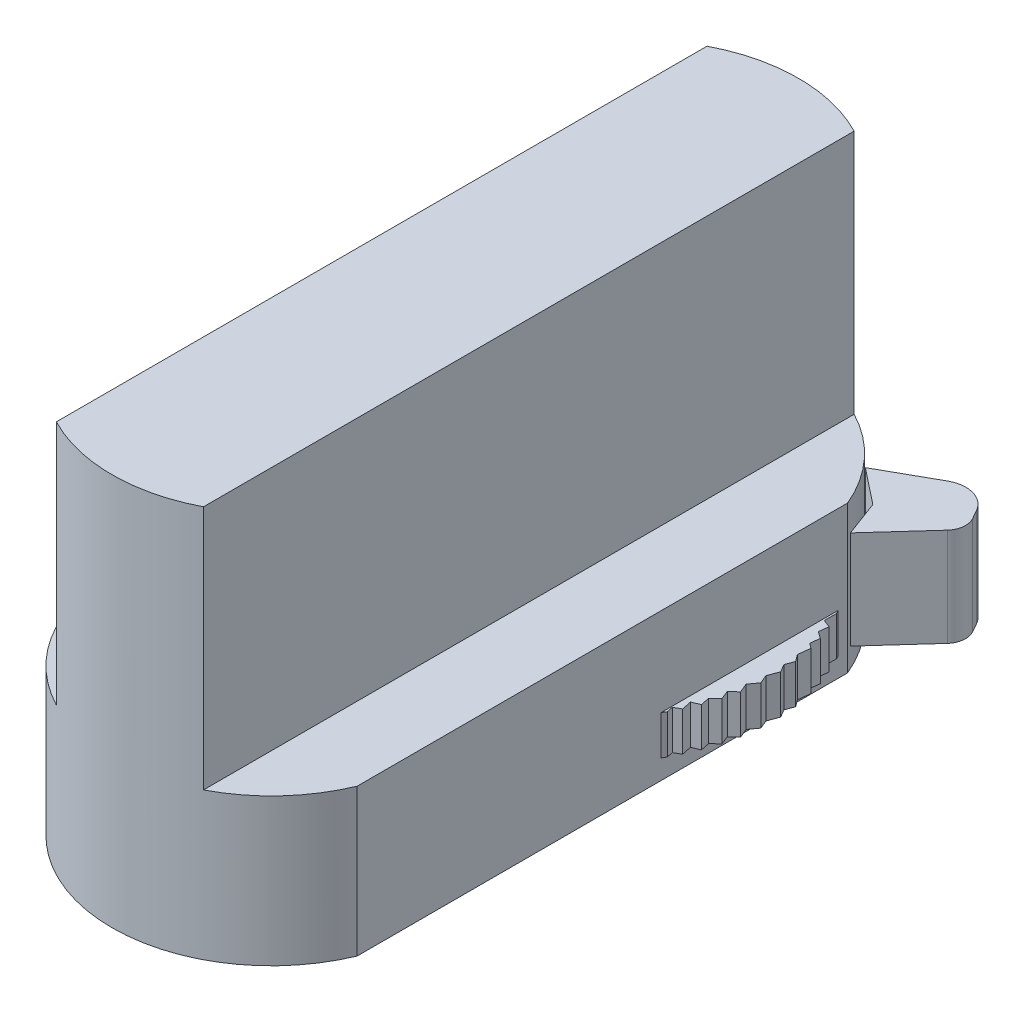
ISO-10303-21;
HEADER;
FILE_DESCRIPTION(('STEP AP214'),'2;1');
FILE_NAME('part.step','',(''),(''),'','','');
FILE_SCHEMA(('AUTOMOTIVE_DESIGN { 1 0 10303 214 1 1 1 1 }'));
ENDSEC;
DATA;
#1=APPLICATION_CONTEXT('core data for automotive mechanical design processes');
#2=APPLICATION_PROTOCOL_DEFINITION('international standard','automotive_design',2000,#1);
#3=PRODUCT_CONTEXT('',#1,'mechanical');
#4=PRODUCT('Part','Part','',(#3));
#5=PRODUCT_RELATED_PRODUCT_CATEGORY('part','',(#4));
#6=PRODUCT_DEFINITION_FORMATION('','',#4);
#7=PRODUCT_DEFINITION_CONTEXT('part definition',#1,'design');
#8=PRODUCT_DEFINITION('design','',#6,#7);
#9=PRODUCT_DEFINITION_SHAPE('','',#8);
#10=(LENGTH_UNIT() NAMED_UNIT(*) SI_UNIT(.MILLI.,.METRE.));
#11=(NAMED_UNIT(*) PLANE_ANGLE_UNIT() SI_UNIT($,.RADIAN.));
#12=(NAMED_UNIT(*) SI_UNIT($,.STERADIAN.) SOLID_ANGLE_UNIT());
#13=UNCERTAINTY_MEASURE_WITH_UNIT(LENGTH_MEASURE(1.E-05),#10,'distance_accuracy_value','');
#14=(GEOMETRIC_REPRESENTATION_CONTEXT(3) GLOBAL_UNCERTAINTY_ASSIGNED_CONTEXT((#13)) GLOBAL_UNIT_ASSIGNED_CONTEXT((#10,
#11,#12)) REPRESENTATION_CONTEXT('',''));
#15=CARTESIAN_POINT('',(0.,0.,0.));
#16=DIRECTION('',(0.,0.,1.));
#17=DIRECTION('',(1.,0.,0.));
#18=AXIS2_PLACEMENT_3D('',#15,#16,#17);
#19=CARTESIAN_POINT('',(13.4208491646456,-8.,-29.1507477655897));
#20=DIRECTION('',(-0.620633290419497,0.,0.784100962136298));
#21=DIRECTION('',(0.784100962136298,0.,0.620633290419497));
#22=AXIS2_PLACEMENT_3D('',#19,#20,#21);
#23=PLANE('',#22);
#24=DIRECTION('',(-0.784100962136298,0.,-0.620633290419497));
#25=VECTOR('',#24,1.);
#26=CARTESIAN_POINT('',(13.4208491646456,-18.,-29.1507477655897));
#27=LINE('',#26,#25);
#28=CARTESIAN_POINT('',(13.4208491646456,-18.,-29.1507477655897));
#29=VERTEX_POINT('',#28);
#30=CARTESIAN_POINT('',(9.78406260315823,-18.,-32.0293449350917));
#31=VERTEX_POINT('',#30);
#32=EDGE_CURVE('E133',#29,#31,#27,.T.);
#33=ORIENTED_EDGE('',*,*,#32,.F.);
#34=DIRECTION('',(0.,-1.,0.));
#35=VECTOR('',#34,1.);
#36=CARTESIAN_POINT('',(13.4208491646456,-8.,-29.1507477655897));
#37=LINE('',#36,#35);
#38=CARTESIAN_POINT('',(13.4208491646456,-8.,-29.1507477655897));
#39=VERTEX_POINT('',#38);
#40=EDGE_CURVE('E12',#39,#29,#37,.T.);
#41=ORIENTED_EDGE('',*,*,#40,.F.);
#42=DIRECTION('',(-0.784100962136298,0.,-0.620633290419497));
#43=VECTOR('',#42,1.);
#44=CARTESIAN_POINT('',(13.4208491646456,-8.,-29.1507477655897));
#45=LINE('',#44,#43);
#46=CARTESIAN_POINT('',(9.78406260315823,-8.,-32.0293449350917));
#47=VERTEX_POINT('',#46);
#48=EDGE_CURVE('E150',#39,#47,#45,.T.);
#49=ORIENTED_EDGE('',*,*,#48,.T.);
#50=DIRECTION('',(0.,-1.,0.));
#51=VECTOR('',#50,1.);
#52=CARTESIAN_POINT('',(9.78406260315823,-8.,-32.0293449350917));
#53=LINE('',#52,#51);
#54=EDGE_CURVE('E45',#47,#31,#53,.T.);
#55=ORIENTED_EDGE('',*,*,#54,.T.);
#56=EDGE_LOOP('',(#33,#41,#49,#55));
#57=FACE_BOUND('',#56,.T.);
#58=ADVANCED_FACE('F42',(#57),#23,.T.);
#59=CARTESIAN_POINT('',(14.7803131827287,-8.,-25.5031357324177));
#60=DIRECTION('',(-0.937035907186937,0.,0.349233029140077));
#61=DIRECTION('',(0.349233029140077,0.,0.937035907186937));
#62=AXIS2_PLACEMENT_3D('',#59,#60,#61);
#63=PLANE('',#62);
#64=DIRECTION('',(-0.349233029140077,0.,-0.937035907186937));
#65=VECTOR('',#64,1.);
#66=CARTESIAN_POINT('',(14.7803131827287,-18.,-25.5031357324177));
#67=LINE('',#66,#65);
#68=CARTESIAN_POINT('',(14.7803131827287,-18.,-25.5031357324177));
#69=VERTEX_POINT('',#68);
#70=EDGE_CURVE('E148',#69,#29,#67,.T.);
#71=ORIENTED_EDGE('',*,*,#70,.F.);
#72=DIRECTION('',(0.,-1.,0.));
#73=VECTOR('',#72,1.);
#74=CARTESIAN_POINT('',(14.7803131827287,-8.,-25.5031357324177));
#75=LINE('',#74,#73);
#76=CARTESIAN_POINT('',(14.7803131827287,-8.,-25.5031357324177));
#77=VERTEX_POINT('',#76);
#78=EDGE_CURVE('E51',#77,#69,#75,.T.);
#79=ORIENTED_EDGE('',*,*,#78,.F.);
#80=DIRECTION('',(-0.349233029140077,0.,-0.937035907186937));
#81=VECTOR('',#80,1.);
#82=CARTESIAN_POINT('',(14.7803131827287,-8.,-25.5031357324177));
#83=LINE('',#82,#81);
#84=EDGE_CURVE('E123',#77,#39,#83,.T.);
#85=ORIENTED_EDGE('',*,*,#84,.T.);
#86=ORIENTED_EDGE('',*,*,#40,.T.);
#87=EDGE_LOOP('',(#71,#79,#85,#86));
#88=FACE_BOUND('',#87,.T.);
#89=ADVANCED_FACE('F160',(#88),#63,.T.);
#90=CARTESIAN_POINT('',(19.4778337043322,-8.,-30.6862562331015));
#91=DIRECTION('',(0.740964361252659,0.,0.671544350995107));
#92=DIRECTION('',(0.671544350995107,0.,-0.740964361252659));
#93=AXIS2_PLACEMENT_3D('',#90,#91,#92);
#94=PLANE('',#93);
#95=DIRECTION('',(-0.671544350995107,0.,0.740964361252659));
#96=VECTOR('',#95,1.);
#97=CARTESIAN_POINT('',(19.4778337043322,-18.,-30.6862562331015));
#98=LINE('',#97,#96);
#99=CARTESIAN_POINT('',(19.4778337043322,-18.,-30.6862562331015));
#100=VERTEX_POINT('',#99);
#101=EDGE_CURVE('E110',#100,#69,#98,.T.);
#102=ORIENTED_EDGE('',*,*,#101,.F.);
#103=DIRECTION('',(0.,-1.,0.));
#104=VECTOR('',#103,1.);
#105=CARTESIAN_POINT('',(19.4778337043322,-8.,-30.6862562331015));
#106=LINE('',#105,#104);
#107=CARTESIAN_POINT('',(19.4778337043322,-8.,-30.6862562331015));
#108=VERTEX_POINT('',#107);
#109=EDGE_CURVE('E105',#108,#100,#106,.T.);
#110=ORIENTED_EDGE('',*,*,#109,.F.);
#111=DIRECTION('',(-0.671544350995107,0.,0.740964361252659));
#112=VECTOR('',#111,1.);
#113=CARTESIAN_POINT('',(19.4778337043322,-8.,-30.6862562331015));
#114=LINE('',#113,#112);
#115=EDGE_CURVE('E108',#108,#77,#114,.T.);
#116=ORIENTED_EDGE('',*,*,#115,.T.);
#117=ORIENTED_EDGE('',*,*,#78,.T.);
#118=EDGE_LOOP('',(#102,#110,#116,#117));
#119=FACE_BOUND('',#118,.T.);
#120=ADVANCED_FACE('F107',(#119),#94,.T.);
#121=CARTESIAN_POINT('',(17.9959049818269,-8.,-32.0293449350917));
#122=DIRECTION('',(0.,-1.,0.));
#123=DIRECTION('',(0.,0.,-1.));
#124=AXIS2_PLACEMENT_3D('',#121,#122,#123);
#125=CYLINDRICAL_SURFACE('',#124,2.);
#126=CARTESIAN_POINT('',(17.9959049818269,-18.,-32.0293449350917));
#127=DIRECTION('',(0.,-1.,0.));
#128=DIRECTION('',(0.,0.,-1.));
#129=AXIS2_PLACEMENT_3D('',#126,#127,#128);
#130=CIRCLE('',#129,2.);
#131=CARTESIAN_POINT('',(19.7407887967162,-18.,-33.0067805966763));
#132=VERTEX_POINT('',#131);
#133=EDGE_CURVE('E145',#132,#100,#130,.T.);
#134=ORIENTED_EDGE('',*,*,#133,.F.);
#135=DIRECTION('',(0.,-1.,0.));
#136=VECTOR('',#135,1.);
#137=CARTESIAN_POINT('',(19.7407887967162,-8.,-33.0067805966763));
#138=LINE('',#137,#136);
#139=CARTESIAN_POINT('',(19.7407887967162,-8.,-33.0067805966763));
#140=VERTEX_POINT('',#139);
#141=EDGE_CURVE('E115',#140,#132,#138,.T.);
#142=ORIENTED_EDGE('',*,*,#141,.F.);
#143=CARTESIAN_POINT('',(17.9959049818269,-8.,-32.0293449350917));
#144=DIRECTION('',(0.,-1.,0.));
#145=DIRECTION('',(0.,0.,-1.));
#146=AXIS2_PLACEMENT_3D('',#143,#144,#145);
#147=CIRCLE('',#146,2.);
#148=EDGE_CURVE('E121',#140,#108,#147,.T.);
#149=ORIENTED_EDGE('',*,*,#148,.T.);
#150=ORIENTED_EDGE('',*,*,#109,.T.);
#151=EDGE_LOOP('',(#134,#142,#149,#150));
#152=FACE_BOUND('',#151,.T.);
#153=ADVANCED_FACE('F125',(#152),#125,.T.);
#154=CARTESIAN_POINT('',(19.2455838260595,-8.,-33.8908031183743));
#155=DIRECTION('',(0.872441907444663,0.,-0.488717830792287));
#156=DIRECTION('',(-0.488717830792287,0.,-0.872441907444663));
#157=AXIS2_PLACEMENT_3D('',#154,#155,#156);
#158=PLANE('',#157);
#159=DIRECTION('',(0.488717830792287,0.,0.872441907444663));
#160=VECTOR('',#159,1.);
#161=CARTESIAN_POINT('',(19.2455838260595,-18.,-33.8908031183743));
#162=LINE('',#161,#160);
#163=CARTESIAN_POINT('',(19.2455838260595,-18.,-33.8908031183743));
#164=VERTEX_POINT('',#163);
#165=EDGE_CURVE('E142',#164,#132,#162,.T.);
#166=ORIENTED_EDGE('',*,*,#165,.F.);
#167=DIRECTION('',(0.,-1.,0.));
#168=VECTOR('',#167,1.);
#169=CARTESIAN_POINT('',(19.2455838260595,-8.,-33.8908031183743));
#170=LINE('',#169,#168);
#171=CARTESIAN_POINT('',(19.2455838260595,-8.,-33.8908031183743));
#172=VERTEX_POINT('',#171);
#173=EDGE_CURVE('E154',#172,#164,#170,.T.);
#174=ORIENTED_EDGE('',*,*,#173,.F.);
#175=DIRECTION('',(0.488717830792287,0.,0.872441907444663));
#176=VECTOR('',#175,1.);
#177=CARTESIAN_POINT('',(19.2455838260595,-8.,-33.8908031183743));
#178=LINE('',#177,#176);
#179=EDGE_CURVE('E126',#172,#140,#178,.T.);
#180=ORIENTED_EDGE('',*,*,#179,.T.);
#181=ORIENTED_EDGE('',*,*,#141,.T.);
#182=EDGE_LOOP('',(#166,#174,#180,#181));
#183=FACE_BOUND('',#182,.T.);
#184=ADVANCED_FACE('F173',(#183),#158,.T.);
#185=CARTESIAN_POINT('',(16.6282581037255,-8.,-32.4246496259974));
#186=DIRECTION('',(0.,-1.,0.));
#187=DIRECTION('',(0.,0.,-1.));
#188=AXIS2_PLACEMENT_3D('',#185,#186,#187);
#189=CYLINDRICAL_SURFACE('',#188,3.);
#190=CARTESIAN_POINT('',(16.6282581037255,-18.,-32.4246496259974));
#191=DIRECTION('',(0.,-1.,0.));
#192=DIRECTION('',(0.,0.,-1.));
#193=AXIS2_PLACEMENT_3D('',#190,#191,#192);
#194=CIRCLE('',#193,3.);
#195=CARTESIAN_POINT('',(15.1621046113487,-18.,-35.0419753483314));
#196=VERTEX_POINT('',#195);
#197=EDGE_CURVE('E139',#196,#164,#194,.T.);
#198=ORIENTED_EDGE('',*,*,#197,.F.);
#199=DIRECTION('',(0.,-1.,0.));
#200=VECTOR('',#199,1.);
#201=CARTESIAN_POINT('',(15.1621046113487,-8.,-35.0419753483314));
#202=LINE('',#201,#200);
#203=CARTESIAN_POINT('',(15.1621046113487,-8.,-35.0419753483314));
#204=VERTEX_POINT('',#203);
#205=EDGE_CURVE('E155',#204,#196,#202,.T.);
#206=ORIENTED_EDGE('',*,*,#205,.F.);
#207=CARTESIAN_POINT('',(16.6282581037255,-8.,-32.4246496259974));
#208=DIRECTION('',(0.,-1.,0.));
#209=DIRECTION('',(0.,0.,-1.));
#210=AXIS2_PLACEMENT_3D('',#207,#208,#209);
#211=CIRCLE('',#210,3.);
#212=EDGE_CURVE('E128',#204,#172,#211,.T.);
#213=ORIENTED_EDGE('',*,*,#212,.T.);
#214=ORIENTED_EDGE('',*,*,#173,.T.);
#215=EDGE_LOOP('',(#198,#206,#213,#214));
#216=FACE_BOUND('',#215,.T.);
#217=ADVANCED_FACE('F176',(#216),#189,.T.);
#218=CARTESIAN_POINT('',(9.78406260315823,-8.,-32.0293449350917));
#219=DIRECTION('',(-0.488717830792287,0.,-0.872441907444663));
#220=DIRECTION('',(-0.872441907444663,0.,0.488717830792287));
#221=AXIS2_PLACEMENT_3D('',#218,#219,#220);
#222=PLANE('',#221);
#223=DIRECTION('',(0.872441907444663,0.,-0.488717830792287));
#224=VECTOR('',#223,1.);
#225=CARTESIAN_POINT('',(9.78406260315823,-18.,-32.0293449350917));
#226=LINE('',#225,#224);
#227=EDGE_CURVE('E136',#31,#196,#226,.T.);
#228=ORIENTED_EDGE('',*,*,#227,.F.);
#229=ORIENTED_EDGE('',*,*,#54,.F.);
#230=DIRECTION('',(0.872441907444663,0.,-0.488717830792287));
#231=VECTOR('',#230,1.);
#232=CARTESIAN_POINT('',(9.78406260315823,-8.,-32.0293449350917));
#233=LINE('',#232,#231);
#234=EDGE_CURVE('E238',#47,#204,#233,.T.);
#235=ORIENTED_EDGE('',*,*,#234,.T.);
#236=ORIENTED_EDGE('',*,*,#205,.T.);
#237=EDGE_LOOP('',(#228,#229,#235,#236));
#238=FACE_BOUND('',#237,.T.);
#239=ADVANCED_FACE('F157',(#238),#222,.T.);
#240=CARTESIAN_POINT('',(16.6282581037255,-8.,-32.4246496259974));
#241=DIRECTION('',(0.,-1.,0.));
#242=DIRECTION('',(0.,0.,-1.));
#243=AXIS2_PLACEMENT_3D('',#240,#241,#242);
#244=PLANE('',#243);
#245=ORIENTED_EDGE('',*,*,#48,.F.);
#246=ORIENTED_EDGE('',*,*,#84,.F.);
#247=ORIENTED_EDGE('',*,*,#115,.F.);
#248=ORIENTED_EDGE('',*,*,#148,.F.);
#249=ORIENTED_EDGE('',*,*,#179,.F.);
#250=ORIENTED_EDGE('',*,*,#212,.F.);
#251=ORIENTED_EDGE('',*,*,#234,.F.);
#252=EDGE_LOOP('',(#245,#246,#247,#248,#249,#250,#251));
#253=FACE_BOUND('',#252,.T.);
#254=ADVANCED_FACE('F119',(#253),#244,.F.);
#255=CARTESIAN_POINT('',(16.6282581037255,-18.,-32.4246496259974));
#256=DIRECTION('',(0.,-1.,0.));
#257=DIRECTION('',(0.,0.,-1.));
#258=AXIS2_PLACEMENT_3D('',#255,#256,#257);
#259=PLANE('',#258);
#260=ORIENTED_EDGE('',*,*,#32,.T.);
#261=ORIENTED_EDGE('',*,*,#227,.T.);
#262=ORIENTED_EDGE('',*,*,#197,.T.);
#263=ORIENTED_EDGE('',*,*,#165,.T.);
#264=ORIENTED_EDGE('',*,*,#133,.T.);
#265=ORIENTED_EDGE('',*,*,#101,.T.);
#266=ORIENTED_EDGE('',*,*,#70,.T.);
#267=EDGE_LOOP('',(#260,#261,#262,#263,#264,#265,#266));
#268=FACE_BOUND('',#267,.T.);
#269=ADVANCED_FACE('F159',(#268),#259,.T.);
#270=CLOSED_SHELL('',(#58,#89,#120,#153,#184,#217,#239,#254,#269));
#271=MANIFOLD_SOLID_BREP('B2',#270);
#272=CARTESIAN_POINT('',(-15.,-5.,-35.));
#273=DIRECTION('',(-1.,0.,0.));
#274=DIRECTION('',(0.,-1.,0.));
#275=AXIS2_PLACEMENT_3D('',#272,#273,#274);
#276=PLANE('',#275);
#277=DIRECTION('',(0.,1.,0.));
#278=VECTOR('',#277,1.);
#279=CARTESIAN_POINT('',(-15.,-28.,-25.));
#280=LINE('',#279,#278);
#281=CARTESIAN_POINT('',(-15.,-20.,-25.));
#282=VERTEX_POINT('',#281);
#283=CARTESIAN_POINT('',(-15.,-5.,-25.));
#284=VERTEX_POINT('',#283);
#285=EDGE_CURVE('E1010',#282,#284,#280,.T.);
#286=ORIENTED_EDGE('',*,*,#285,.F.);
#287=DIRECTION('',(0.,0.,1.));
#288=VECTOR('',#287,1.);
#289=CARTESIAN_POINT('',(-15.,-20.,-35.));
#290=LINE('',#289,#288);
#291=CARTESIAN_POINT('',(-15.,-20.,25.));
#292=VERTEX_POINT('',#291);
#293=EDGE_CURVE('E1041',#282,#292,#290,.T.);
#294=ORIENTED_EDGE('',*,*,#293,.T.);
#295=DIRECTION('',(0.,1.,0.));
#296=VECTOR('',#295,1.);
#297=CARTESIAN_POINT('',(-15.,-28.,25.));
#298=LINE('',#297,#296);
#299=CARTESIAN_POINT('',(-15.,-5.,25.));
#300=VERTEX_POINT('',#299);
#301=EDGE_CURVE('E1009',#292,#300,#298,.T.);
#302=ORIENTED_EDGE('',*,*,#301,.T.);
#303=DIRECTION('',(0.,0.,1.));
#304=VECTOR('',#303,1.);
#305=CARTESIAN_POINT('',(-15.,-5.,-35.));
#306=LINE('',#305,#304);
#307=EDGE_CURVE('E1045',#284,#300,#306,.T.);
#308=ORIENTED_EDGE('',*,*,#307,.F.);
#309=EDGE_LOOP('',(#286,#294,#302,#308));
#310=FACE_BOUND('',#309,.T.);
#311=DIRECTION('',(0.,-1.,0.));
#312=VECTOR('',#311,1.);
#313=CARTESIAN_POINT('',(-15.,-14.,-24.01387818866));
#314=LINE('',#313,#312);
#315=CARTESIAN_POINT('',(-15.,-14.,-24.01387818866));
#316=VERTEX_POINT('',#315);
#317=CARTESIAN_POINT('',(-15.,-18.,-24.01387818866));
#318=VERTEX_POINT('',#317);
#319=EDGE_CURVE('E258',#316,#318,#314,.T.);
#320=ORIENTED_EDGE('',*,*,#319,.F.);
#321=DIRECTION('',(0.,0.,1.));
#322=VECTOR('',#321,1.);
#323=CARTESIAN_POINT('',(-15.,-14.,-35.));
#324=LINE('',#323,#322);
#325=CARTESIAN_POINT('',(-15.,-14.,-5.98612181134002));
#326=VERTEX_POINT('',#325);
#327=EDGE_CURVE('E262',#316,#326,#324,.T.);
#328=ORIENTED_EDGE('',*,*,#327,.T.);
#329=DIRECTION('',(0.,-1.,0.));
#330=VECTOR('',#329,1.);
#331=CARTESIAN_POINT('',(-15.,-14.,-5.98612181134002));
#332=LINE('',#331,#330);
#333=CARTESIAN_POINT('',(-15.,-18.,-5.98612181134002));
#334=VERTEX_POINT('',#333);
#335=EDGE_CURVE('E996',#334,#326,#332,.F.);
#336=ORIENTED_EDGE('',*,*,#335,.F.);
#337=DIRECTION('',(0.,0.,1.));
#338=VECTOR('',#337,1.);
#339=CARTESIAN_POINT('',(-15.,-18.,-35.));
#340=LINE('',#339,#338);
#341=EDGE_CURVE('E904',#318,#334,#340,.T.);
#342=ORIENTED_EDGE('',*,*,#341,.F.);
#343=EDGE_LOOP('',(#320,#328,#336,#342));
#344=FACE_BOUND('',#343,.T.);
#345=ADVANCED_FACE('F243',(#310,#344),#276,.T.);
#346=CARTESIAN_POINT('',(15.,-5.,-35.));
#347=DIRECTION('',(1.,0.,0.));
#348=DIRECTION('',(0.,1.,0.));
#349=AXIS2_PLACEMENT_3D('',#346,#347,#348);
#350=PLANE('',#349);
#351=DIRECTION('',(0.,1.,0.));
#352=VECTOR('',#351,1.);
#353=CARTESIAN_POINT('',(15.,-28.,-25.));
#354=LINE('',#353,#352);
#355=CARTESIAN_POINT('',(15.,-20.,-25.));
#356=VERTEX_POINT('',#355);
#357=CARTESIAN_POINT('',(15.,-5.,-25.));
#358=VERTEX_POINT('',#357);
#359=EDGE_CURVE('E1008',#356,#358,#354,.T.);
#360=ORIENTED_EDGE('',*,*,#359,.T.);
#361=DIRECTION('',(0.,0.,1.));
#362=VECTOR('',#361,1.);
#363=CARTESIAN_POINT('',(15.,-5.,-35.));
#364=LINE('',#363,#362);
#365=CARTESIAN_POINT('',(15.,-5.,25.));
#366=VERTEX_POINT('',#365);
#367=EDGE_CURVE('E1060',#358,#366,#364,.T.);
#368=ORIENTED_EDGE('',*,*,#367,.T.);
#369=DIRECTION('',(0.,1.,0.));
#370=VECTOR('',#369,1.);
#371=CARTESIAN_POINT('',(15.,-28.,25.));
#372=LINE('',#371,#370);
#373=CARTESIAN_POINT('',(15.,-20.,25.));
#374=VERTEX_POINT('',#373);
#375=EDGE_CURVE('E1016',#374,#366,#372,.T.);
#376=ORIENTED_EDGE('',*,*,#375,.F.);
#377=DIRECTION('',(0.,0.,1.));
#378=VECTOR('',#377,1.);
#379=CARTESIAN_POINT('',(15.,-20.,-35.));
#380=LINE('',#379,#378);
#381=EDGE_CURVE('E1040',#356,#374,#380,.T.);
#382=ORIENTED_EDGE('',*,*,#381,.F.);
#383=EDGE_LOOP('',(#360,#368,#376,#382));
#384=FACE_BOUND('',#383,.T.);
#385=DIRECTION('',(0.,-1.,0.));
#386=VECTOR('',#385,1.);
#387=CARTESIAN_POINT('',(15.,-14.,-5.98612181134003));
#388=LINE('',#387,#386);
#389=CARTESIAN_POINT('',(15.,-14.,-5.98612181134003));
#390=VERTEX_POINT('',#389);
#391=CARTESIAN_POINT('',(15.,-18.,-5.98612181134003));
#392=VERTEX_POINT('',#391);
#393=EDGE_CURVE('E1067',#390,#392,#388,.T.);
#394=ORIENTED_EDGE('',*,*,#393,.F.);
#395=DIRECTION('',(0.,0.,-1.));
#396=VECTOR('',#395,1.);
#397=CARTESIAN_POINT('',(15.,-14.,-35.));
#398=LINE('',#397,#396);
#399=CARTESIAN_POINT('',(15.,-14.,-24.01387818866));
#400=VERTEX_POINT('',#399);
#401=EDGE_CURVE('E40',#390,#400,#398,.T.);
#402=ORIENTED_EDGE('',*,*,#401,.T.);
#403=DIRECTION('',(0.,-1.,0.));
#404=VECTOR('',#403,1.);
#405=CARTESIAN_POINT('',(15.,-14.,-24.01387818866));
#406=LINE('',#405,#404);
#407=CARTESIAN_POINT('',(15.,-18.,-24.01387818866));
#408=VERTEX_POINT('',#407);
#409=EDGE_CURVE('E251',#408,#400,#406,.F.);
#410=ORIENTED_EDGE('',*,*,#409,.F.);
#411=DIRECTION('',(0.,0.,-1.));
#412=VECTOR('',#411,1.);
#413=CARTESIAN_POINT('',(15.,-18.,-35.));
#414=LINE('',#413,#412);
#415=EDGE_CURVE('E1044',#392,#408,#414,.T.);
#416=ORIENTED_EDGE('',*,*,#415,.F.);
#417=EDGE_LOOP('',(#394,#402,#410,#416));
#418=FACE_BOUND('',#417,.T.);
#419=ADVANCED_FACE('F1082',(#384,#418),#350,.T.);
#420=CARTESIAN_POINT('',(15.,-20.,-35.));
#421=DIRECTION('',(0.,-1.,0.));
#422=DIRECTION('',(0.,0.,-1.));
#423=AXIS2_PLACEMENT_3D('',#420,#421,#422);
#424=PLANE('',#423);
#425=CARTESIAN_POINT('',(0.,-20.,18.));
#426=DIRECTION('',(0.,-1.,0.));
#427=DIRECTION('',(0.,0.,-1.));
#428=AXIS2_PLACEMENT_3D('',#425,#426,#427);
#429=CIRCLE('',#428,6.);
#430=CARTESIAN_POINT('',(0.,-20.,12.));
#431=VERTEX_POINT('',#430);
#432=EDGE_CURVE('E999',#431,#431,#429,.T.);
#433=ORIENTED_EDGE('',*,*,#432,.F.);
#434=EDGE_LOOP('',(#433));
#435=FACE_BOUND('',#434,.T.);
#436=ORIENTED_EDGE('',*,*,#293,.F.);
#437=CARTESIAN_POINT('',(0.,-20.,-18.75));
#438=DIRECTION('',(0.,-1.,0.));
#439=DIRECTION('',(0.,0.,-1.));
#440=AXIS2_PLACEMENT_3D('',#437,#438,#439);
#441=CIRCLE('',#440,16.25);
#442=EDGE_CURVE('E1022',#356,#282,#441,.F.);
#443=ORIENTED_EDGE('',*,*,#442,.F.);
#444=ORIENTED_EDGE('',*,*,#381,.T.);
#445=CARTESIAN_POINT('',(0.,-20.,18.75));
#446=DIRECTION('',(0.,-1.,0.));
#447=DIRECTION('',(0.,0.,-1.));
#448=AXIS2_PLACEMENT_3D('',#445,#446,#447);
#449=CIRCLE('',#448,16.25);
#450=EDGE_CURVE('E1020',#292,#374,#449,.F.);
#451=ORIENTED_EDGE('',*,*,#450,.F.);
#452=EDGE_LOOP('',(#436,#443,#444,#451));
#453=FACE_BOUND('',#452,.T.);
#454=ADVANCED_FACE('F245',(#435,#453),#424,.T.);
#455=CARTESIAN_POINT('',(-7.5,-5.,-35.));
#456=DIRECTION('',(0.,1.,0.));
#457=DIRECTION('',(0.,0.,1.));
#458=AXIS2_PLACEMENT_3D('',#455,#456,#457);
#459=PLANE('',#458);
#460=CARTESIAN_POINT('',(0.,-5.,-18.75));
#461=DIRECTION('',(0.,1.,0.));
#462=DIRECTION('',(0.,0.,1.));
#463=AXIS2_PLACEMENT_3D('',#460,#461,#462);
#464=CIRCLE('',#463,16.25);
#465=CARTESIAN_POINT('',(-7.50000000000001,-5.,-33.1657032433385));
#466=VERTEX_POINT('',#465);
#467=EDGE_CURVE('E1038',#284,#466,#464,.F.);
#468=ORIENTED_EDGE('',*,*,#467,.F.);
#469=ORIENTED_EDGE('',*,*,#307,.T.);
#470=CARTESIAN_POINT('',(0.,-5.,18.75));
#471=DIRECTION('',(0.,1.,0.));
#472=DIRECTION('',(0.,0.,1.));
#473=AXIS2_PLACEMENT_3D('',#470,#471,#472);
#474=CIRCLE('',#473,16.25);
#475=CARTESIAN_POINT('',(-7.50000000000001,-5.,33.1657032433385));
#476=VERTEX_POINT('',#475);
#477=EDGE_CURVE('E1023',#476,#300,#474,.F.);
#478=ORIENTED_EDGE('',*,*,#477,.F.);
#479=DIRECTION('',(0.,0.,1.));
#480=VECTOR('',#479,1.);
#481=CARTESIAN_POINT('',(-7.5,-5.,-35.));
#482=LINE('',#481,#480);
#483=EDGE_CURVE('E1048',#466,#476,#482,.T.);
#484=ORIENTED_EDGE('',*,*,#483,.F.);
#485=EDGE_LOOP('',(#468,#469,#478,#484));
#486=FACE_BOUND('',#485,.T.);
#487=ADVANCED_FACE('F1089',(#486),#459,.T.);
#488=CARTESIAN_POINT('',(-7.5,20.,-35.));
#489=DIRECTION('',(0.,1.,0.));
#490=DIRECTION('',(0.,0.,1.));
#491=AXIS2_PLACEMENT_3D('',#488,#489,#490);
#492=PLANE('',#491);
#493=CARTESIAN_POINT('',(0.,20.,-18.75));
#494=DIRECTION('',(0.,-1.,0.));
#495=DIRECTION('',(0.,0.,-1.));
#496=AXIS2_PLACEMENT_3D('',#493,#494,#495);
#497=CIRCLE('',#496,16.25);
#498=CARTESIAN_POINT('',(-7.5,20.,-33.1657032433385));
#499=VERTEX_POINT('',#498);
#500=CARTESIAN_POINT('',(7.5,20.,-33.1657032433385));
#501=VERTEX_POINT('',#500);
#502=EDGE_CURVE('E1006',#499,#501,#497,.T.);
#503=ORIENTED_EDGE('',*,*,#502,.F.);
#504=DIRECTION('',(0.,0.,1.));
#505=VECTOR('',#504,1.);
#506=CARTESIAN_POINT('',(-7.5,20.,-35.));
#507=LINE('',#506,#505);
#508=CARTESIAN_POINT('',(-7.5,20.,33.1657032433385));
#509=VERTEX_POINT('',#508);
#510=EDGE_CURVE('E1051',#499,#509,#507,.T.);
#511=ORIENTED_EDGE('',*,*,#510,.T.);
#512=CARTESIAN_POINT('',(0.,20.,18.75));
#513=DIRECTION('',(0.,-1.,0.));
#514=DIRECTION('',(0.,0.,1.));
#515=AXIS2_PLACEMENT_3D('',#512,#513,#514);
#516=CIRCLE('',#515,16.25);
#517=CARTESIAN_POINT('',(7.5,20.,33.1657032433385));
#518=VERTEX_POINT('',#517);
#519=EDGE_CURVE('E1003',#518,#509,#516,.T.);
#520=ORIENTED_EDGE('',*,*,#519,.F.);
#521=DIRECTION('',(0.,0.,1.));
#522=VECTOR('',#521,1.);
#523=CARTESIAN_POINT('',(7.5,20.,-35.));
#524=LINE('',#523,#522);
#525=EDGE_CURVE('E1054',#501,#518,#524,.T.);
#526=ORIENTED_EDGE('',*,*,#525,.F.);
#527=EDGE_LOOP('',(#503,#511,#520,#526));
#528=FACE_BOUND('',#527,.T.);
#529=ADVANCED_FACE('F1098',(#528),#492,.T.);
#530=CARTESIAN_POINT('',(7.5,-5.,-35.));
#531=DIRECTION('',(0.,1.,0.));
#532=DIRECTION('',(0.,0.,1.));
#533=AXIS2_PLACEMENT_3D('',#530,#531,#532);
#534=PLANE('',#533);
#535=CARTESIAN_POINT('',(0.,-5.,-18.75));
#536=DIRECTION('',(0.,1.,0.));
#537=DIRECTION('',(0.,0.,1.));
#538=AXIS2_PLACEMENT_3D('',#535,#536,#537);
#539=CIRCLE('',#538,16.25);
#540=CARTESIAN_POINT('',(7.5,-5.,-33.1657032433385));
#541=VERTEX_POINT('',#540);
#542=EDGE_CURVE('E1032',#541,#358,#539,.F.);
#543=ORIENTED_EDGE('',*,*,#542,.F.);
#544=DIRECTION('',(0.,0.,1.));
#545=VECTOR('',#544,1.);
#546=CARTESIAN_POINT('',(7.5,-5.,-35.));
#547=LINE('',#546,#545);
#548=CARTESIAN_POINT('',(7.5,-5.,33.1657032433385));
#549=VERTEX_POINT('',#548);
#550=EDGE_CURVE('E1057',#541,#549,#547,.T.);
#551=ORIENTED_EDGE('',*,*,#550,.T.);
#552=CARTESIAN_POINT('',(0.,-5.,18.75));
#553=DIRECTION('',(0.,1.,0.));
#554=DIRECTION('',(0.,0.,1.));
#555=AXIS2_PLACEMENT_3D('',#552,#553,#554);
#556=CIRCLE('',#555,16.25);
#557=EDGE_CURVE('E1012',#366,#549,#556,.F.);
#558=ORIENTED_EDGE('',*,*,#557,.F.);
#559=ORIENTED_EDGE('',*,*,#367,.F.);
#560=EDGE_LOOP('',(#543,#551,#558,#559));
#561=FACE_BOUND('',#560,.T.);
#562=ADVANCED_FACE('F1094',(#561),#534,.T.);
#563=CARTESIAN_POINT('',(-7.5,20.,-35.));
#564=DIRECTION('',(-1.,0.,0.));
#565=DIRECTION('',(0.,-1.,0.));
#566=AXIS2_PLACEMENT_3D('',#563,#564,#565);
#567=PLANE('',#566);
#568=DIRECTION('',(0.,1.,0.));
#569=VECTOR('',#568,1.);
#570=CARTESIAN_POINT('',(-7.50000000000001,-28.,-33.1657032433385));
#571=LINE('',#570,#569);
#572=EDGE_CURVE('E1036',#466,#499,#571,.T.);
#573=ORIENTED_EDGE('',*,*,#572,.F.);
#574=ORIENTED_EDGE('',*,*,#483,.T.);
#575=DIRECTION('',(0.,1.,0.));
#576=VECTOR('',#575,1.);
#577=CARTESIAN_POINT('',(-7.50000000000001,-28.,33.1657032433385));
#578=LINE('',#577,#576);
#579=EDGE_CURVE('E1028',#509,#476,#578,.F.);
#580=ORIENTED_EDGE('',*,*,#579,.F.);
#581=ORIENTED_EDGE('',*,*,#510,.F.);
#582=EDGE_LOOP('',(#573,#574,#580,#581));
#583=FACE_BOUND('',#582,.T.);
#584=ADVANCED_FACE('F1097',(#583),#567,.T.);
#585=CARTESIAN_POINT('',(7.5,20.,-35.));
#586=DIRECTION('',(1.,0.,0.));
#587=DIRECTION('',(0.,1.,0.));
#588=AXIS2_PLACEMENT_3D('',#585,#586,#587);
#589=PLANE('',#588);
#590=DIRECTION('',(0.,1.,0.));
#591=VECTOR('',#590,1.);
#592=CARTESIAN_POINT('',(7.50000000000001,-28.,-33.1657032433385));
#593=LINE('',#592,#591);
#594=EDGE_CURVE('E1034',#501,#541,#593,.F.);
#595=ORIENTED_EDGE('',*,*,#594,.F.);
#596=ORIENTED_EDGE('',*,*,#525,.T.);
#597=DIRECTION('',(0.,1.,0.));
#598=VECTOR('',#597,1.);
#599=CARTESIAN_POINT('',(7.50000000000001,-28.,33.1657032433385));
#600=LINE('',#599,#598);
#601=EDGE_CURVE('E1025',#549,#518,#600,.T.);
#602=ORIENTED_EDGE('',*,*,#601,.F.);
#603=ORIENTED_EDGE('',*,*,#550,.F.);
#604=EDGE_LOOP('',(#595,#596,#602,#603));
#605=FACE_BOUND('',#604,.T.);
#606=ADVANCED_FACE('F1100',(#605),#589,.T.);
#607=CARTESIAN_POINT('',(0.,-28.,18.75));
#608=DIRECTION('',(0.,1.,0.));
#609=DIRECTION('',(0.,0.,1.));
#610=AXIS2_PLACEMENT_3D('',#607,#608,#609);
#611=CYLINDRICAL_SURFACE('',#610,16.25);
#612=ORIENTED_EDGE('',*,*,#450,.T.);
#613=ORIENTED_EDGE('',*,*,#375,.T.);
#614=ORIENTED_EDGE('',*,*,#557,.T.);
#615=ORIENTED_EDGE('',*,*,#601,.T.);
#616=ORIENTED_EDGE('',*,*,#519,.T.);
#617=ORIENTED_EDGE('',*,*,#579,.T.);
#618=ORIENTED_EDGE('',*,*,#477,.T.);
#619=ORIENTED_EDGE('',*,*,#301,.F.);
#620=EDGE_LOOP('',(#612,#613,#614,#615,#616,#617,#618,#619));
#621=FACE_BOUND('',#620,.T.);
#622=ADVANCED_FACE('F1103',(#621),#611,.T.);
#623=CARTESIAN_POINT('',(0.,-28.,-18.75));
#624=DIRECTION('',(0.,1.,0.));
#625=DIRECTION('',(0.,0.,1.));
#626=AXIS2_PLACEMENT_3D('',#623,#624,#625);
#627=CYLINDRICAL_SURFACE('',#626,16.25);
#628=ORIENTED_EDGE('',*,*,#442,.T.);
#629=ORIENTED_EDGE('',*,*,#285,.T.);
#630=ORIENTED_EDGE('',*,*,#467,.T.);
#631=ORIENTED_EDGE('',*,*,#572,.T.);
#632=ORIENTED_EDGE('',*,*,#502,.T.);
#633=ORIENTED_EDGE('',*,*,#594,.T.);
#634=ORIENTED_EDGE('',*,*,#542,.T.);
#635=ORIENTED_EDGE('',*,*,#359,.F.);
#636=EDGE_LOOP('',(#628,#629,#630,#631,#632,#633,#634,#635));
#637=FACE_BOUND('',#636,.T.);
#638=ADVANCED_FACE('F1116',(#637),#627,.T.);
#639=CARTESIAN_POINT('',(0.,-17.,18.));
#640=DIRECTION('',(0.,-1.,0.));
#641=DIRECTION('',(0.,0.,-1.));
#642=AXIS2_PLACEMENT_3D('',#639,#640,#641);
#643=CYLINDRICAL_SURFACE('',#642,6.);
#644=CARTESIAN_POINT('',(0.,-17.,18.));
#645=DIRECTION('',(0.,-1.,0.));
#646=DIRECTION('',(0.,0.,-1.));
#647=AXIS2_PLACEMENT_3D('',#644,#645,#646);
#648=CIRCLE('',#647,6.);
#649=CARTESIAN_POINT('',(0.,-17.,12.));
#650=VERTEX_POINT('',#649);
#651=EDGE_CURVE('E1000',#650,#650,#648,.T.);
#652=ORIENTED_EDGE('',*,*,#651,.F.);
#653=EDGE_LOOP('',(#652));
#654=FACE_BOUND('',#653,.T.);
#655=ORIENTED_EDGE('',*,*,#432,.T.);
#656=EDGE_LOOP('',(#655));
#657=FACE_BOUND('',#656,.T.);
#658=ADVANCED_FACE('F1120',(#654,#657),#643,.F.);
#659=CARTESIAN_POINT('',(0.,-17.,18.));
#660=DIRECTION('',(0.,-1.,0.));
#661=DIRECTION('',(0.,0.,-1.));
#662=AXIS2_PLACEMENT_3D('',#659,#660,#661);
#663=PLANE('',#662);
#664=ORIENTED_EDGE('',*,*,#651,.T.);
#665=EDGE_LOOP('',(#664));
#666=FACE_BOUND('',#665,.T.);
#667=ADVANCED_FACE('F1124',(#666),#663,.T.);
#668=CARTESIAN_POINT('',(15.1013272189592,-14.,-7.02642531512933));
#669=DIRECTION('',(0.978963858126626,0.,-0.204033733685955));
#670=DIRECTION('',(-0.204033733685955,0.,-0.978963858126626));
#671=AXIS2_PLACEMENT_3D('',#668,#669,#670);
#672=PLANE('',#671);
#673=DIRECTION('',(0.204033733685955,0.,0.978963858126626));
#674=VECTOR('',#673,1.);
#675=CARTESIAN_POINT('',(15.1013272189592,-18.,-7.02642531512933));
#676=LINE('',#675,#674);
#677=CARTESIAN_POINT('',(15.1013272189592,-18.,-7.02642531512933));
#678=VERTEX_POINT('',#677);
#679=CARTESIAN_POINT('',(15.2343593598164,-18.,-6.3881305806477));
#680=VERTEX_POINT('',#679);
#681=EDGE_CURVE('E830',#678,#680,#676,.T.);
#682=ORIENTED_EDGE('',*,*,#681,.F.);
#683=DIRECTION('',(0.,-1.,0.));
#684=VECTOR('',#683,1.);
#685=CARTESIAN_POINT('',(15.1013272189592,-14.,-7.02642531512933));
#686=LINE('',#685,#684);
#687=CARTESIAN_POINT('',(15.1013272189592,-14.,-7.02642531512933));
#688=VERTEX_POINT('',#687);
#689=EDGE_CURVE('E952',#688,#678,#686,.T.);
#690=ORIENTED_EDGE('',*,*,#689,.F.);
#691=DIRECTION('',(0.204033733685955,0.,0.978963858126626));
#692=VECTOR('',#691,1.);
#693=CARTESIAN_POINT('',(15.1013272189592,-14.,-7.02642531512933));
#694=LINE('',#693,#692);
#695=CARTESIAN_POINT('',(15.2343593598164,-14.,-6.3881305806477));
#696=VERTEX_POINT('',#695);
#697=EDGE_CURVE('E693',#688,#696,#694,.T.);
#698=ORIENTED_EDGE('',*,*,#697,.T.);
#699=DIRECTION('',(0.,-1.,0.));
#700=VECTOR('',#699,1.);
#701=CARTESIAN_POINT('',(15.2343593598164,-14.,-6.3881305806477));
#702=LINE('',#701,#700);
#703=EDGE_CURVE('E950',#696,#680,#702,.T.);
#704=ORIENTED_EDGE('',*,*,#703,.T.);
#705=EDGE_LOOP('',(#682,#690,#698,#704));
#706=FACE_BOUND('',#705,.T.);
#707=ADVANCED_FACE('F1079',(#706),#672,.T.);
#708=CARTESIAN_POINT('',(15.7711579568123,-14.,-7.41576788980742));
#709=DIRECTION('',(0.502529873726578,0.,0.864559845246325));
#710=DIRECTION('',(0.864559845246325,0.,-0.502529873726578));
#711=AXIS2_PLACEMENT_3D('',#708,#709,#710);
#712=PLANE('',#711);
#713=DIRECTION('',(-0.864559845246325,0.,0.502529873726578));
#714=VECTOR('',#713,1.);
#715=CARTESIAN_POINT('',(15.7711579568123,-18.,-7.41576788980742));
#716=LINE('',#715,#714);
#717=CARTESIAN_POINT('',(15.7711579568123,-18.,-7.41576788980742));
#718=VERTEX_POINT('',#717);
#719=EDGE_CURVE('E827',#718,#678,#716,.T.);
#720=ORIENTED_EDGE('',*,*,#719,.F.);
#721=DIRECTION('',(0.,-1.,0.));
#722=VECTOR('',#721,1.);
#723=CARTESIAN_POINT('',(15.7711579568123,-14.,-7.41576788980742));
#724=LINE('',#723,#722);
#725=CARTESIAN_POINT('',(15.7711579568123,-14.,-7.41576788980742));
#726=VERTEX_POINT('',#725);
#727=EDGE_CURVE('E954',#726,#718,#724,.T.);
#728=ORIENTED_EDGE('',*,*,#727,.F.);
#729=DIRECTION('',(-0.864559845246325,0.,0.502529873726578));
#730=VECTOR('',#729,1.);
#731=CARTESIAN_POINT('',(15.7711579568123,-14.,-7.41576788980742));
#732=LINE('',#731,#730);
#733=EDGE_CURVE('E690',#726,#688,#732,.T.);
#734=ORIENTED_EDGE('',*,*,#733,.T.);
#735=ORIENTED_EDGE('',*,*,#689,.T.);
#736=EDGE_LOOP('',(#720,#728,#734,#735));
#737=FACE_BOUND('',#736,.T.);
#738=ADVANCED_FACE('F1209',(#737),#712,.T.);
#739=CARTESIAN_POINT('',(15.5613748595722,-14.,-8.42231747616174));
#740=DIRECTION('',(0.978963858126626,0.,-0.204033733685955));
#741=DIRECTION('',(-0.204033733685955,0.,-0.978963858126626));
#742=AXIS2_PLACEMENT_3D('',#739,#740,#741);
#743=PLANE('',#742);
#744=DIRECTION('',(0.204033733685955,0.,0.978963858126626));
#745=VECTOR('',#744,1.);
#746=CARTESIAN_POINT('',(15.5613748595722,-18.,-8.42231747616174));
#747=LINE('',#746,#745);
#748=CARTESIAN_POINT('',(15.5613748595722,-18.,-8.42231747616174));
#749=VERTEX_POINT('',#748);
#750=EDGE_CURVE('E824',#749,#718,#747,.T.);
#751=ORIENTED_EDGE('',*,*,#750,.F.);
#752=DIRECTION('',(0.,-1.,0.));
#753=VECTOR('',#752,1.);
#754=CARTESIAN_POINT('',(15.5613748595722,-14.,-8.42231747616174));
#755=LINE('',#754,#753);
#756=CARTESIAN_POINT('',(15.5613748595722,-14.,-8.42231747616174));
#757=VERTEX_POINT('',#756);
#758=EDGE_CURVE('E956',#757,#749,#755,.T.);
#759=ORIENTED_EDGE('',*,*,#758,.F.);
#760=DIRECTION('',(0.204033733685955,0.,0.978963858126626));
#761=VECTOR('',#760,1.);
#762=CARTESIAN_POINT('',(15.5613748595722,-14.,-8.42231747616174));
#763=LINE('',#762,#761);
#764=EDGE_CURVE('E687',#757,#726,#763,.T.);
#765=ORIENTED_EDGE('',*,*,#764,.T.);
#766=ORIENTED_EDGE('',*,*,#727,.T.);
#767=EDGE_LOOP('',(#751,#759,#765,#766));
#768=FACE_BOUND('',#767,.T.);
#769=ADVANCED_FACE('F1205',(#768),#743,.T.);
#770=CARTESIAN_POINT('',(16.3455971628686,-14.,-8.74928376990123));
#771=DIRECTION('',(0.384822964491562,0.,0.922990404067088));
#772=DIRECTION('',(0.922990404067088,0.,-0.384822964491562));
#773=AXIS2_PLACEMENT_3D('',#770,#771,#772);
#774=PLANE('',#773);
#775=DIRECTION('',(-0.922990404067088,0.,0.384822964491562));
#776=VECTOR('',#775,1.);
#777=CARTESIAN_POINT('',(16.3455971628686,-18.,-8.74928376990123));
#778=LINE('',#777,#776);
#779=CARTESIAN_POINT('',(16.3455971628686,-18.,-8.74928376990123));
#780=VERTEX_POINT('',#779);
#781=EDGE_CURVE('E821',#780,#749,#778,.T.);
#782=ORIENTED_EDGE('',*,*,#781,.F.);
#783=DIRECTION('',(0.,-1.,0.));
#784=VECTOR('',#783,1.);
#785=CARTESIAN_POINT('',(16.3455971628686,-14.,-8.74928376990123));
#786=LINE('',#785,#784);
#787=CARTESIAN_POINT('',(16.3455971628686,-14.,-8.74928376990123));
#788=VERTEX_POINT('',#787);
#789=EDGE_CURVE('E958',#788,#780,#786,.T.);
#790=ORIENTED_EDGE('',*,*,#789,.F.);
#791=DIRECTION('',(-0.922990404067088,0.,0.384822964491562));
#792=VECTOR('',#791,1.);
#793=CARTESIAN_POINT('',(16.3455971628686,-14.,-8.74928376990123));
#794=LINE('',#793,#792);
#795=EDGE_CURVE('E684',#788,#757,#794,.T.);
#796=ORIENTED_EDGE('',*,*,#795,.T.);
#797=ORIENTED_EDGE('',*,*,#758,.T.);
#798=EDGE_LOOP('',(#782,#790,#796,#797));
#799=FACE_BOUND('',#798,.T.);
#800=ADVANCED_FACE('F1201',(#799),#774,.T.);
#801=CARTESIAN_POINT('',(16.15223386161,-14.,-9.67705037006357));
#802=DIRECTION('',(0.978963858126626,0.,-0.204033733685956));
#803=DIRECTION('',(-0.204033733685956,0.,-0.978963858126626));
#804=AXIS2_PLACEMENT_3D('',#801,#802,#803);
#805=PLANE('',#804);
#806=DIRECTION('',(0.204033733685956,0.,0.978963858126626));
#807=VECTOR('',#806,1.);
#808=CARTESIAN_POINT('',(16.15223386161,-18.,-9.67705037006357));
#809=LINE('',#808,#807);
#810=CARTESIAN_POINT('',(16.15223386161,-18.,-9.67705037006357));
#811=VERTEX_POINT('',#810);
#812=EDGE_CURVE('E818',#811,#780,#809,.T.);
#813=ORIENTED_EDGE('',*,*,#812,.F.);
#814=DIRECTION('',(0.,-1.,0.));
#815=VECTOR('',#814,1.);
#816=CARTESIAN_POINT('',(16.15223386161,-14.,-9.67705037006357));
#817=LINE('',#816,#815);
#818=CARTESIAN_POINT('',(16.15223386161,-14.,-9.67705037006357));
#819=VERTEX_POINT('',#818);
#820=EDGE_CURVE('E960',#819,#811,#817,.T.);
#821=ORIENTED_EDGE('',*,*,#820,.F.);
#822=DIRECTION('',(0.204033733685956,0.,0.978963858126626));
#823=VECTOR('',#822,1.);
#824=CARTESIAN_POINT('',(16.15223386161,-14.,-9.67705037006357));
#825=LINE('',#824,#823);
#826=EDGE_CURVE('E681',#819,#788,#825,.T.);
#827=ORIENTED_EDGE('',*,*,#826,.T.);
#828=ORIENTED_EDGE('',*,*,#789,.T.);
#829=EDGE_LOOP('',(#813,#821,#827,#828));
#830=FACE_BOUND('',#829,.T.);
#831=ADVANCED_FACE('F1197',(#830),#805,.T.);
#832=CARTESIAN_POINT('',(16.8627778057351,-14.,-10.3206063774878));
#833=DIRECTION('',(0.671304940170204,0.,0.741181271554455));
#834=DIRECTION('',(0.741181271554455,0.,-0.671304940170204));
#835=AXIS2_PLACEMENT_3D('',#832,#833,#834);
#836=PLANE('',#835);
#837=DIRECTION('',(-0.741181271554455,0.,0.671304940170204));
#838=VECTOR('',#837,1.);
#839=CARTESIAN_POINT('',(16.8627778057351,-18.,-10.3206063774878));
#840=LINE('',#839,#838);
#841=CARTESIAN_POINT('',(16.8627778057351,-18.,-10.3206063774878));
#842=VERTEX_POINT('',#841);
#843=EDGE_CURVE('E815',#842,#811,#840,.T.);
#844=ORIENTED_EDGE('',*,*,#843,.F.);
#845=DIRECTION('',(0.,-1.,0.));
#846=VECTOR('',#845,1.);
#847=CARTESIAN_POINT('',(16.8627778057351,-14.,-10.3206063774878));
#848=LINE('',#847,#846);
#849=CARTESIAN_POINT('',(16.8627778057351,-14.,-10.3206063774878));
#850=VERTEX_POINT('',#849);
#851=EDGE_CURVE('E962',#850,#842,#848,.T.);
#852=ORIENTED_EDGE('',*,*,#851,.F.);
#853=DIRECTION('',(-0.741181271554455,0.,0.671304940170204));
#854=VECTOR('',#853,1.);
#855=CARTESIAN_POINT('',(16.8627778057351,-14.,-10.3206063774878));
#856=LINE('',#855,#854);
#857=EDGE_CURVE('E678',#850,#819,#856,.T.);
#858=ORIENTED_EDGE('',*,*,#857,.T.);
#859=ORIENTED_EDGE('',*,*,#820,.T.);
#860=EDGE_LOOP('',(#844,#852,#858,#859));
#861=FACE_BOUND('',#860,.T.);
#862=ADVANCED_FACE('F1193',(#861),#836,.T.);
#863=CARTESIAN_POINT('',(16.5074241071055,-14.,-11.2280460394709));
#864=DIRECTION('',(0.931149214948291,0.,-0.364638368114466));
#865=DIRECTION('',(-0.364638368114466,0.,-0.931149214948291));
#866=AXIS2_PLACEMENT_3D('',#863,#864,#865);
#867=PLANE('',#866);
#868=DIRECTION('',(0.364638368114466,0.,0.931149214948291));
#869=VECTOR('',#868,1.);
#870=CARTESIAN_POINT('',(16.5074241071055,-18.,-11.2280460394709));
#871=LINE('',#870,#869);
#872=CARTESIAN_POINT('',(16.5074241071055,-18.,-11.2280460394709));
#873=VERTEX_POINT('',#872);
#874=EDGE_CURVE('E812',#873,#842,#871,.T.);
#875=ORIENTED_EDGE('',*,*,#874,.F.);
#876=DIRECTION('',(0.,-1.,0.));
#877=VECTOR('',#876,1.);
#878=CARTESIAN_POINT('',(16.5074241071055,-14.,-11.2280460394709));
#879=LINE('',#878,#877);
#880=CARTESIAN_POINT('',(16.5074241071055,-14.,-11.2280460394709));
#881=VERTEX_POINT('',#880);
#882=EDGE_CURVE('E964',#881,#873,#879,.T.);
#883=ORIENTED_EDGE('',*,*,#882,.F.);
#884=DIRECTION('',(0.364638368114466,0.,0.931149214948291));
#885=VECTOR('',#884,1.);
#886=CARTESIAN_POINT('',(16.5074241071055,-14.,-11.2280460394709));
#887=LINE('',#886,#885);
#888=EDGE_CURVE('E675',#881,#850,#887,.T.);
#889=ORIENTED_EDGE('',*,*,#888,.T.);
#890=ORIENTED_EDGE('',*,*,#851,.T.);
#891=EDGE_LOOP('',(#875,#883,#889,#890));
#892=FACE_BOUND('',#891,.T.);
#893=ADVANCED_FACE('F1189',(#892),#867,.T.);
#894=CARTESIAN_POINT('',(17.2181315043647,-14.,-11.8717500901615));
#895=DIRECTION('',(0.671304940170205,0.,0.741181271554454));
#896=DIRECTION('',(0.741181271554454,0.,-0.671304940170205));
#897=AXIS2_PLACEMENT_3D('',#894,#895,#896);
#898=PLANE('',#897);
#899=DIRECTION('',(-0.741181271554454,0.,0.671304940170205));
#900=VECTOR('',#899,1.);
#901=CARTESIAN_POINT('',(17.2181315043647,-18.,-11.8717500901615));
#902=LINE('',#901,#900);
#903=CARTESIAN_POINT('',(17.2181315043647,-18.,-11.8717500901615));
#904=VERTEX_POINT('',#903);
#905=EDGE_CURVE('E809',#904,#873,#902,.T.);
#906=ORIENTED_EDGE('',*,*,#905,.F.);
#907=DIRECTION('',(0.,-1.,0.));
#908=VECTOR('',#907,1.);
#909=CARTESIAN_POINT('',(17.2181315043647,-14.,-11.8717500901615));
#910=LINE('',#909,#908);
#911=CARTESIAN_POINT('',(17.2181315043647,-14.,-11.8717500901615));
#912=VERTEX_POINT('',#911);
#913=EDGE_CURVE('E966',#912,#904,#910,.T.);
#914=ORIENTED_EDGE('',*,*,#913,.F.);
#915=DIRECTION('',(-0.741181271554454,0.,0.671304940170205));
#916=VECTOR('',#915,1.);
#917=CARTESIAN_POINT('',(17.2181315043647,-14.,-11.8717500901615));
#918=LINE('',#917,#916);
#919=EDGE_CURVE('E672',#912,#881,#918,.T.);
#920=ORIENTED_EDGE('',*,*,#919,.T.);
#921=ORIENTED_EDGE('',*,*,#882,.T.);
#922=EDGE_LOOP('',(#906,#914,#920,#921));
#923=FACE_BOUND('',#922,.T.);
#924=ADVANCED_FACE('F1185',(#923),#898,.T.);
#925=CARTESIAN_POINT('',(16.8183557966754,-14.,-12.8306043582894));
#926=DIRECTION('',(0.922990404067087,0.,-0.384822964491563));
#927=DIRECTION('',(-0.384822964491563,0.,-0.922990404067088));
#928=AXIS2_PLACEMENT_3D('',#925,#926,#927);
#929=PLANE('',#928);
#930=DIRECTION('',(0.384822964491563,0.,0.922990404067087));
#931=VECTOR('',#930,1.);
#932=CARTESIAN_POINT('',(16.8183557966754,-18.,-12.8306043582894));
#933=LINE('',#932,#931);
#934=CARTESIAN_POINT('',(16.8183557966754,-18.,-12.8306043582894));
#935=VERTEX_POINT('',#934);
#936=EDGE_CURVE('E806',#935,#904,#933,.T.);
#937=ORIENTED_EDGE('',*,*,#936,.F.);
#938=DIRECTION('',(0.,-1.,0.));
#939=VECTOR('',#938,1.);
#940=CARTESIAN_POINT('',(16.8183557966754,-14.,-12.8306043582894));
#941=LINE('',#940,#939);
#942=CARTESIAN_POINT('',(16.8183557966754,-14.,-12.8306043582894));
#943=VERTEX_POINT('',#942);
#944=EDGE_CURVE('E968',#943,#935,#941,.T.);
#945=ORIENTED_EDGE('',*,*,#944,.F.);
#946=DIRECTION('',(0.384822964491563,0.,0.922990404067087));
#947=VECTOR('',#946,1.);
#948=CARTESIAN_POINT('',(16.8183557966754,-14.,-12.8306043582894));
#949=LINE('',#948,#947);
#950=EDGE_CURVE('E669',#943,#912,#949,.T.);
#951=ORIENTED_EDGE('',*,*,#950,.T.);
#952=ORIENTED_EDGE('',*,*,#913,.T.);
#953=EDGE_LOOP('',(#937,#945,#951,#952));
#954=FACE_BOUND('',#953,.T.);
#955=ADVANCED_FACE('F1181',(#954),#929,.T.);
#956=CARTESIAN_POINT('',(17.4518359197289,-14.,-13.7025320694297));
#957=DIRECTION('',(0.809022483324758,0.,0.58777769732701));
#958=DIRECTION('',(0.58777769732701,0.,-0.809022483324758));
#959=AXIS2_PLACEMENT_3D('',#956,#957,#958);
#960=PLANE('',#959);
#961=DIRECTION('',(-0.58777769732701,0.,0.809022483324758));
#962=VECTOR('',#961,1.);
#963=CARTESIAN_POINT('',(17.4518359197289,-18.,-13.7025320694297));
#964=LINE('',#963,#962);
#965=CARTESIAN_POINT('',(17.4518359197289,-18.,-13.7025320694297));
#966=VERTEX_POINT('',#965);
#967=EDGE_CURVE('E803',#966,#935,#964,.T.);
#968=ORIENTED_EDGE('',*,*,#967,.F.);
#969=DIRECTION('',(0.,-1.,0.));
#970=VECTOR('',#969,1.);
#971=CARTESIAN_POINT('',(17.4518359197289,-14.,-13.7025320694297));
#972=LINE('',#971,#970);
#973=CARTESIAN_POINT('',(17.4518359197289,-14.,-13.7025320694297));
#974=VERTEX_POINT('',#973);
#975=EDGE_CURVE('E970',#974,#966,#972,.T.);
#976=ORIENTED_EDGE('',*,*,#975,.F.);
#977=DIRECTION('',(-0.58777769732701,0.,0.809022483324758));
#978=VECTOR('',#977,1.);
#979=CARTESIAN_POINT('',(17.4518359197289,-14.,-13.7025320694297));
#980=LINE('',#979,#978);
#981=EDGE_CURVE('E666',#974,#943,#980,.T.);
#982=ORIENTED_EDGE('',*,*,#981,.T.);
#983=ORIENTED_EDGE('',*,*,#944,.T.);
#984=EDGE_LOOP('',(#968,#976,#982,#983));
#985=FACE_BOUND('',#984,.T.);
#986=ADVANCED_FACE('F1177',(#985),#960,.T.);
#987=CARTESIAN_POINT('',(17.0823444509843,-14.,-14.5887501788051));
#988=DIRECTION('',(0.922990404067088,0.,-0.384822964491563));
#989=DIRECTION('',(-0.384822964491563,0.,-0.922990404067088));
#990=AXIS2_PLACEMENT_3D('',#987,#988,#989);
#991=PLANE('',#990);
#992=DIRECTION('',(0.384822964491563,0.,0.922990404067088));
#993=VECTOR('',#992,1.);
#994=CARTESIAN_POINT('',(17.0823444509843,-18.,-14.5887501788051));
#995=LINE('',#994,#993);
#996=CARTESIAN_POINT('',(17.0823444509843,-18.,-14.5887501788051));
#997=VERTEX_POINT('',#996);
#998=EDGE_CURVE('E800',#997,#966,#995,.T.);
#999=ORIENTED_EDGE('',*,*,#998,.F.);
#1000=DIRECTION('',(0.,-1.,0.));
#1001=VECTOR('',#1000,1.);
#1002=CARTESIAN_POINT('',(17.0823444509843,-14.,-14.5887501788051));
#1003=LINE('',#1002,#1001);
#1004=CARTESIAN_POINT('',(17.0823444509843,-14.,-14.5887501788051));
#1005=VERTEX_POINT('',#1004);
#1006=EDGE_CURVE('E972',#1005,#997,#1003,.T.);
#1007=ORIENTED_EDGE('',*,*,#1006,.F.);
#1008=DIRECTION('',(0.384822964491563,0.,0.922990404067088));
#1009=VECTOR('',#1008,1.);
#1010=CARTESIAN_POINT('',(17.0823444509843,-14.,-14.5887501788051));
#1011=LINE('',#1010,#1009);
#1012=EDGE_CURVE('E663',#1005,#974,#1011,.T.);
#1013=ORIENTED_EDGE('',*,*,#1012,.T.);
#1014=ORIENTED_EDGE('',*,*,#975,.T.);
#1015=EDGE_LOOP('',(#999,#1007,#1013,#1014));
#1016=FACE_BOUND('',#1015,.T.);
#1017=ADVANCED_FACE('F1173',(#1016),#991,.T.);
#1018=CARTESIAN_POINT('',(17.48650727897,-14.,-15.6870685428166));
#1019=DIRECTION('',(0.938476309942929,0.,0.345343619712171));
#1020=DIRECTION('',(0.345343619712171,0.,-0.938476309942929));
#1021=AXIS2_PLACEMENT_3D('',#1018,#1019,#1020);
#1022=PLANE('',#1021);
#1023=DIRECTION('',(-0.345343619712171,0.,0.938476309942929));
#1024=VECTOR('',#1023,1.);
#1025=CARTESIAN_POINT('',(17.48650727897,-18.,-15.6870685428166));
#1026=LINE('',#1025,#1024);
#1027=CARTESIAN_POINT('',(17.48650727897,-18.,-15.6870685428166));
#1028=VERTEX_POINT('',#1027);
#1029=EDGE_CURVE('E797',#1028,#997,#1026,.T.);
#1030=ORIENTED_EDGE('',*,*,#1029,.F.);
#1031=DIRECTION('',(0.,-1.,0.));
#1032=VECTOR('',#1031,1.);
#1033=CARTESIAN_POINT('',(17.48650727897,-14.,-15.6870685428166));
#1034=LINE('',#1033,#1032);
#1035=CARTESIAN_POINT('',(17.48650727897,-14.,-15.6870685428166));
#1036=VERTEX_POINT('',#1035);
#1037=EDGE_CURVE('E974',#1036,#1028,#1034,.T.);
#1038=ORIENTED_EDGE('',*,*,#1037,.F.);
#1039=DIRECTION('',(-0.345343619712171,0.,0.938476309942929));
#1040=VECTOR('',#1039,1.);
#1041=CARTESIAN_POINT('',(17.48650727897,-14.,-15.6870685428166));
#1042=LINE('',#1041,#1040);
#1043=EDGE_CURVE('E660',#1036,#1005,#1042,.T.);
#1044=ORIENTED_EDGE('',*,*,#1043,.T.);
#1045=ORIENTED_EDGE('',*,*,#1006,.T.);
#1046=EDGE_LOOP('',(#1030,#1038,#1044,#1045));
#1047=FACE_BOUND('',#1046,.T.);
#1048=ADVANCED_FACE('F1169',(#1047),#1022,.T.);
#1049=CARTESIAN_POINT('',(17.0190974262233,-14.,-16.4912073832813));
#1050=DIRECTION('',(0.864559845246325,0.,-0.502529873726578));
#1051=DIRECTION('',(-0.502529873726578,0.,-0.864559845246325));
#1052=AXIS2_PLACEMENT_3D('',#1049,#1050,#1051);
#1053=PLANE('',#1052);
#1054=DIRECTION('',(0.502529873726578,0.,0.864559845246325));
#1055=VECTOR('',#1054,1.);
#1056=CARTESIAN_POINT('',(17.0190974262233,-18.,-16.4912073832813));
#1057=LINE('',#1056,#1055);
#1058=CARTESIAN_POINT('',(17.0190974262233,-18.,-16.4912073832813));
#1059=VERTEX_POINT('',#1058);
#1060=EDGE_CURVE('E794',#1059,#1028,#1057,.T.);
#1061=ORIENTED_EDGE('',*,*,#1060,.F.);
#1062=DIRECTION('',(0.,-1.,0.));
#1063=VECTOR('',#1062,1.);
#1064=CARTESIAN_POINT('',(17.0190974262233,-14.,-16.4912073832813));
#1065=LINE('',#1064,#1063);
#1066=CARTESIAN_POINT('',(17.0190974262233,-14.,-16.4912073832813));
#1067=VERTEX_POINT('',#1066);
#1068=EDGE_CURVE('E976',#1067,#1059,#1065,.T.);
#1069=ORIENTED_EDGE('',*,*,#1068,.F.);
#1070=DIRECTION('',(0.502529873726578,0.,0.864559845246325));
#1071=VECTOR('',#1070,1.);
#1072=CARTESIAN_POINT('',(17.0190974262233,-14.,-16.4912073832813));
#1073=LINE('',#1072,#1071);
#1074=EDGE_CURVE('E657',#1067,#1036,#1073,.T.);
#1075=ORIENTED_EDGE('',*,*,#1074,.T.);
#1076=ORIENTED_EDGE('',*,*,#1037,.T.);
#1077=EDGE_LOOP('',(#1061,#1069,#1075,#1076));
#1078=FACE_BOUND('',#1077,.T.);
#1079=ADVANCED_FACE('F1165',(#1078),#1053,.T.);
#1080=CARTESIAN_POINT('',(17.3397765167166,-14.,-17.3626574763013));
#1081=DIRECTION('',(0.938476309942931,0.,0.345343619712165));
#1082=DIRECTION('',(0.345343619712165,0.,-0.938476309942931));
#1083=AXIS2_PLACEMENT_3D('',#1080,#1081,#1082);
#1084=PLANE('',#1083);
#1085=DIRECTION('',(-0.345343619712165,0.,0.938476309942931));
#1086=VECTOR('',#1085,1.);
#1087=CARTESIAN_POINT('',(17.3397765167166,-18.,-17.3626574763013));
#1088=LINE('',#1087,#1086);
#1089=CARTESIAN_POINT('',(17.3397765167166,-18.,-17.3626574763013));
#1090=VERTEX_POINT('',#1089);
#1091=EDGE_CURVE('E791',#1090,#1059,#1088,.T.);
#1092=ORIENTED_EDGE('',*,*,#1091,.F.);
#1093=DIRECTION('',(0.,-1.,0.));
#1094=VECTOR('',#1093,1.);
#1095=CARTESIAN_POINT('',(17.3397765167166,-14.,-17.3626574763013));
#1096=LINE('',#1095,#1094);
#1097=CARTESIAN_POINT('',(17.3397765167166,-14.,-17.3626574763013));
#1098=VERTEX_POINT('',#1097);
#1099=EDGE_CURVE('E978',#1098,#1090,#1096,.T.);
#1100=ORIENTED_EDGE('',*,*,#1099,.F.);
#1101=DIRECTION('',(-0.345343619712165,0.,0.938476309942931));
#1102=VECTOR('',#1101,1.);
#1103=CARTESIAN_POINT('',(17.3397765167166,-14.,-17.3626574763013));
#1104=LINE('',#1103,#1102);
#1105=EDGE_CURVE('E654',#1098,#1067,#1104,.T.);
#1106=ORIENTED_EDGE('',*,*,#1105,.T.);
#1107=ORIENTED_EDGE('',*,*,#1068,.T.);
#1108=EDGE_LOOP('',(#1092,#1100,#1106,#1107));
#1109=FACE_BOUND('',#1108,.T.);
#1110=ADVANCED_FACE('F1161',(#1109),#1084,.T.);
#1111=CARTESIAN_POINT('',(16.8183557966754,-14.,-18.0663174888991));
#1112=DIRECTION('',(0.803452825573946,0.,-0.59536842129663));
#1113=DIRECTION('',(-0.59536842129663,0.,-0.803452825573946));
#1114=AXIS2_PLACEMENT_3D('',#1111,#1112,#1113);
#1115=PLANE('',#1114);
#1116=DIRECTION('',(0.59536842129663,0.,0.803452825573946));
#1117=VECTOR('',#1116,1.);
#1118=CARTESIAN_POINT('',(16.8183557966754,-18.,-18.0663174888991));
#1119=LINE('',#1118,#1117);
#1120=CARTESIAN_POINT('',(16.8183557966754,-18.,-18.0663174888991));
#1121=VERTEX_POINT('',#1120);
#1122=EDGE_CURVE('E788',#1121,#1090,#1119,.T.);
#1123=ORIENTED_EDGE('',*,*,#1122,.F.);
#1124=DIRECTION('',(0.,-1.,0.));
#1125=VECTOR('',#1124,1.);
#1126=CARTESIAN_POINT('',(16.8183557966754,-14.,-18.0663174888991));
#1127=LINE('',#1126,#1125);
#1128=CARTESIAN_POINT('',(16.8183557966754,-14.,-18.0663174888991));
#1129=VERTEX_POINT('',#1128);
#1130=EDGE_CURVE('E980',#1129,#1121,#1127,.T.);
#1131=ORIENTED_EDGE('',*,*,#1130,.F.);
#1132=DIRECTION('',(0.59536842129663,0.,0.803452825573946));
#1133=VECTOR('',#1132,1.);
#1134=CARTESIAN_POINT('',(16.8183557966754,-14.,-18.0663174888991));
#1135=LINE('',#1134,#1133);
#1136=EDGE_CURVE('E651',#1129,#1098,#1135,.T.);
#1137=ORIENTED_EDGE('',*,*,#1136,.T.);
#1138=ORIENTED_EDGE('',*,*,#1099,.T.);
#1139=EDGE_LOOP('',(#1123,#1131,#1137,#1138));
#1140=FACE_BOUND('',#1139,.T.);
#1141=ADVANCED_FACE('F1157',(#1140),#1115,.T.);
#1142=CARTESIAN_POINT('',(16.9619078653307,-14.,-19.3062375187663));
#1143=DIRECTION('',(0.993364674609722,0.,0.115007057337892));
#1144=DIRECTION('',(0.115007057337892,0.,-0.993364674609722));
#1145=AXIS2_PLACEMENT_3D('',#1142,#1143,#1144);
#1146=PLANE('',#1145);
#1147=DIRECTION('',(-0.115007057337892,0.,0.993364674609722));
#1148=VECTOR('',#1147,1.);
#1149=CARTESIAN_POINT('',(16.9619078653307,-18.,-19.3062375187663));
#1150=LINE('',#1149,#1148);
#1151=CARTESIAN_POINT('',(16.9619078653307,-18.,-19.3062375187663));
#1152=VERTEX_POINT('',#1151);
#1153=EDGE_CURVE('E785',#1152,#1121,#1150,.T.);
#1154=ORIENTED_EDGE('',*,*,#1153,.F.);
#1155=DIRECTION('',(0.,-1.,0.));
#1156=VECTOR('',#1155,1.);
#1157=CARTESIAN_POINT('',(16.9619078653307,-14.,-19.3062375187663));
#1158=LINE('',#1157,#1156);
#1159=CARTESIAN_POINT('',(16.9619078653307,-14.,-19.3062375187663));
#1160=VERTEX_POINT('',#1159);
#1161=EDGE_CURVE('E982',#1160,#1152,#1158,.T.);
#1162=ORIENTED_EDGE('',*,*,#1161,.F.);
#1163=DIRECTION('',(-0.115007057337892,0.,0.993364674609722));
#1164=VECTOR('',#1163,1.);
#1165=CARTESIAN_POINT('',(16.9619078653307,-14.,-19.3062375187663));
#1166=LINE('',#1165,#1164);
#1167=EDGE_CURVE('E648',#1160,#1129,#1166,.T.);
#1168=ORIENTED_EDGE('',*,*,#1167,.T.);
#1169=ORIENTED_EDGE('',*,*,#1130,.T.);
#1170=EDGE_LOOP('',(#1154,#1162,#1168,#1169));
#1171=FACE_BOUND('',#1170,.T.);
#1172=ADVANCED_FACE('F1153',(#1171),#1146,.T.);
#1173=CARTESIAN_POINT('',(16.4512443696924,-14.,-19.6772489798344));
#1174=DIRECTION('',(0.587777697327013,0.,-0.809022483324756));
#1175=DIRECTION('',(-0.809022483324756,0.,-0.587777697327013));
#1176=AXIS2_PLACEMENT_3D('',#1173,#1174,#1175);
#1177=PLANE('',#1176);
#1178=DIRECTION('',(0.809022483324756,0.,0.587777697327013));
#1179=VECTOR('',#1178,1.);
#1180=CARTESIAN_POINT('',(16.4512443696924,-18.,-19.6772489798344));
#1181=LINE('',#1180,#1179);
#1182=CARTESIAN_POINT('',(16.4512443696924,-18.,-19.6772489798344));
#1183=VERTEX_POINT('',#1182);
#1184=EDGE_CURVE('E782',#1183,#1152,#1181,.T.);
#1185=ORIENTED_EDGE('',*,*,#1184,.F.);
#1186=DIRECTION('',(0.,-1.,0.));
#1187=VECTOR('',#1186,1.);
#1188=CARTESIAN_POINT('',(16.4512443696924,-14.,-19.6772489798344));
#1189=LINE('',#1188,#1187);
#1190=CARTESIAN_POINT('',(16.4512443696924,-14.,-19.6772489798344));
#1191=VERTEX_POINT('',#1190);
#1192=EDGE_CURVE('E984',#1191,#1183,#1189,.T.);
#1193=ORIENTED_EDGE('',*,*,#1192,.F.);
#1194=DIRECTION('',(0.809022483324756,0.,0.587777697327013));
#1195=VECTOR('',#1194,1.);
#1196=CARTESIAN_POINT('',(16.4512443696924,-14.,-19.6772489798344));
#1197=LINE('',#1196,#1195);
#1198=EDGE_CURVE('E645',#1191,#1160,#1197,.T.);
#1199=ORIENTED_EDGE('',*,*,#1198,.T.);
#1200=ORIENTED_EDGE('',*,*,#1161,.T.);
#1201=EDGE_LOOP('',(#1185,#1193,#1199,#1200));
#1202=FACE_BOUND('',#1201,.T.);
#1203=ADVANCED_FACE('F1149',(#1202),#1177,.T.);
#1204=CARTESIAN_POINT('',(16.5636038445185,-14.,-20.6477453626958));
#1205=DIRECTION('',(0.993364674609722,0.,0.115007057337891));
#1206=DIRECTION('',(0.115007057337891,0.,-0.993364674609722));
#1207=AXIS2_PLACEMENT_3D('',#1204,#1205,#1206);
#1208=PLANE('',#1207);
#1209=DIRECTION('',(-0.115007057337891,0.,0.993364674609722));
#1210=VECTOR('',#1209,1.);
#1211=CARTESIAN_POINT('',(16.5636038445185,-18.,-20.6477453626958));
#1212=LINE('',#1211,#1210);
#1213=CARTESIAN_POINT('',(16.5636038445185,-18.,-20.6477453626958));
#1214=VERTEX_POINT('',#1213);
#1215=EDGE_CURVE('E779',#1214,#1183,#1212,.T.);
#1216=ORIENTED_EDGE('',*,*,#1215,.F.);
#1217=DIRECTION('',(0.,-1.,0.));
#1218=VECTOR('',#1217,1.);
#1219=CARTESIAN_POINT('',(16.5636038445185,-14.,-20.6477453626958));
#1220=LINE('',#1219,#1218);
#1221=CARTESIAN_POINT('',(16.5636038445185,-14.,-20.6477453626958));
#1222=VERTEX_POINT('',#1221);
#1223=EDGE_CURVE('E986',#1222,#1214,#1220,.T.);
#1224=ORIENTED_EDGE('',*,*,#1223,.F.);
#1225=DIRECTION('',(-0.115007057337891,0.,0.993364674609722));
#1226=VECTOR('',#1225,1.);
#1227=CARTESIAN_POINT('',(16.5636038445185,-14.,-20.6477453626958));
#1228=LINE('',#1227,#1226);
#1229=EDGE_CURVE('E642',#1222,#1191,#1228,.T.);
#1230=ORIENTED_EDGE('',*,*,#1229,.T.);
#1231=ORIENTED_EDGE('',*,*,#1192,.T.);
#1232=EDGE_LOOP('',(#1216,#1224,#1230,#1231));
#1233=FACE_BOUND('',#1232,.T.);
#1234=ADVANCED_FACE('F1145',(#1233),#1208,.T.);
#1235=CARTESIAN_POINT('',(15.8638035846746,-14.,-21.1561700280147));
#1236=DIRECTION('',(0.587777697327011,0.,-0.809022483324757));
#1237=DIRECTION('',(-0.809022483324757,0.,-0.587777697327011));
#1238=AXIS2_PLACEMENT_3D('',#1235,#1236,#1237);
#1239=PLANE('',#1238);
#1240=DIRECTION('',(0.809022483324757,0.,0.587777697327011));
#1241=VECTOR('',#1240,1.);
#1242=CARTESIAN_POINT('',(15.8638035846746,-18.,-21.1561700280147));
#1243=LINE('',#1242,#1241);
#1244=CARTESIAN_POINT('',(15.8638035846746,-18.,-21.1561700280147));
#1245=VERTEX_POINT('',#1244);
#1246=EDGE_CURVE('E776',#1245,#1214,#1243,.T.);
#1247=ORIENTED_EDGE('',*,*,#1246,.F.);
#1248=DIRECTION('',(0.,-1.,0.));
#1249=VECTOR('',#1248,1.);
#1250=CARTESIAN_POINT('',(15.8638035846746,-14.,-21.1561700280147));
#1251=LINE('',#1250,#1249);
#1252=CARTESIAN_POINT('',(15.8638035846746,-14.,-21.1561700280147));
#1253=VERTEX_POINT('',#1252);
#1254=EDGE_CURVE('E988',#1253,#1245,#1251,.T.);
#1255=ORIENTED_EDGE('',*,*,#1254,.F.);
#1256=DIRECTION('',(0.809022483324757,0.,0.587777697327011));
#1257=VECTOR('',#1256,1.);
#1258=CARTESIAN_POINT('',(15.8638035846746,-14.,-21.1561700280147));
#1259=LINE('',#1258,#1257);
#1260=EDGE_CURVE('E639',#1253,#1222,#1259,.T.);
#1261=ORIENTED_EDGE('',*,*,#1260,.T.);
#1262=ORIENTED_EDGE('',*,*,#1223,.T.);
#1263=EDGE_LOOP('',(#1247,#1255,#1261,#1262));
#1264=FACE_BOUND('',#1263,.T.);
#1265=ADVANCED_FACE('F1141',(#1264),#1239,.T.);
#1266=CARTESIAN_POINT('',(15.9775991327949,-14.,-22.1390703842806));
#1267=DIRECTION('',(0.993364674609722,0.,0.115007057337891));
#1268=DIRECTION('',(0.115007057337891,0.,-0.993364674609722));
#1269=AXIS2_PLACEMENT_3D('',#1266,#1267,#1268);
#1270=PLANE('',#1269);
#1271=DIRECTION('',(-0.115007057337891,0.,0.993364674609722));
#1272=VECTOR('',#1271,1.);
#1273=CARTESIAN_POINT('',(15.9775991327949,-18.,-22.1390703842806));
#1274=LINE('',#1273,#1272);
#1275=CARTESIAN_POINT('',(15.9775991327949,-18.,-22.1390703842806));
#1276=VERTEX_POINT('',#1275);
#1277=EDGE_CURVE('E773',#1276,#1245,#1274,.T.);
#1278=ORIENTED_EDGE('',*,*,#1277,.F.);
#1279=DIRECTION('',(0.,-1.,0.));
#1280=VECTOR('',#1279,1.);
#1281=CARTESIAN_POINT('',(15.9775991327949,-14.,-22.1390703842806));
#1282=LINE('',#1281,#1280);
#1283=CARTESIAN_POINT('',(15.9775991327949,-14.,-22.1390703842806));
#1284=VERTEX_POINT('',#1283);
#1285=EDGE_CURVE('E990',#1284,#1276,#1282,.T.);
#1286=ORIENTED_EDGE('',*,*,#1285,.F.);
#1287=DIRECTION('',(-0.115007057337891,0.,0.993364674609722));
#1288=VECTOR('',#1287,1.);
#1289=CARTESIAN_POINT('',(15.9775991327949,-14.,-22.1390703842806));
#1290=LINE('',#1289,#1288);
#1291=EDGE_CURVE('E633',#1284,#1253,#1290,.T.);
#1292=ORIENTED_EDGE('',*,*,#1291,.T.);
#1293=ORIENTED_EDGE('',*,*,#1254,.T.);
#1294=EDGE_LOOP('',(#1278,#1286,#1292,#1293));
#1295=FACE_BOUND('',#1294,.T.);
#1296=ADVANCED_FACE('F1137',(#1295),#1270,.T.);
#1297=CARTESIAN_POINT('',(15.1866897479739,-14.,-22.4301118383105));
#1298=DIRECTION('',(0.345343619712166,0.,-0.93847630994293));
#1299=DIRECTION('',(-0.93847630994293,0.,-0.345343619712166));
#1300=AXIS2_PLACEMENT_3D('',#1297,#1298,#1299);
#1301=PLANE('',#1300);
#1302=DIRECTION('',(0.93847630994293,0.,0.345343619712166));
#1303=VECTOR('',#1302,1.);
#1304=CARTESIAN_POINT('',(15.1866897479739,-18.,-22.4301118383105));
#1305=LINE('',#1304,#1303);
#1306=CARTESIAN_POINT('',(15.1866897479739,-18.,-22.4301118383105));
#1307=VERTEX_POINT('',#1306);
#1308=EDGE_CURVE('E770',#1307,#1276,#1305,.T.);
#1309=ORIENTED_EDGE('',*,*,#1308,.F.);
#1310=DIRECTION('',(0.,-1.,0.));
#1311=VECTOR('',#1310,1.);
#1312=CARTESIAN_POINT('',(15.1866897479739,-14.,-22.4301118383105));
#1313=LINE('',#1312,#1311);
#1314=CARTESIAN_POINT('',(15.1866897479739,-14.,-22.4301118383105));
#1315=VERTEX_POINT('',#1314);
#1316=EDGE_CURVE('E624',#1315,#1307,#1313,.T.);
#1317=ORIENTED_EDGE('',*,*,#1316,.F.);
#1318=DIRECTION('',(0.93847630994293,0.,0.345343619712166));
#1319=VECTOR('',#1318,1.);
#1320=CARTESIAN_POINT('',(15.1866897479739,-14.,-22.4301118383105));
#1321=LINE('',#1320,#1319);
#1322=EDGE_CURVE('E631',#1315,#1284,#1321,.T.);
#1323=ORIENTED_EDGE('',*,*,#1322,.T.);
#1324=ORIENTED_EDGE('',*,*,#1285,.T.);
#1325=EDGE_LOOP('',(#1309,#1317,#1323,#1324));
#1326=FACE_BOUND('',#1325,.T.);
#1327=ADVANCED_FACE('F1134',(#1326),#1301,.T.);
#1328=CARTESIAN_POINT('',(15.1866897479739,-14.,-23.6956572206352));
#1329=DIRECTION('',(1.,0.,0.));
#1330=DIRECTION('',(0.,0.,-1.));
#1331=AXIS2_PLACEMENT_3D('',#1328,#1329,#1330);
#1332=PLANE('',#1331);
#1333=DIRECTION('',(0.,0.,1.));
#1334=VECTOR('',#1333,1.);
#1335=CARTESIAN_POINT('',(15.1866897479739,-18.,-23.6956572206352));
#1336=LINE('',#1335,#1334);
#1337=CARTESIAN_POINT('',(15.1866897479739,-18.,-23.6956572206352));
#1338=VERTEX_POINT('',#1337);
#1339=EDGE_CURVE('E623',#1338,#1307,#1336,.T.);
#1340=ORIENTED_EDGE('',*,*,#1339,.F.);
#1341=DIRECTION('',(0.,-1.,0.));
#1342=VECTOR('',#1341,1.);
#1343=CARTESIAN_POINT('',(15.1866897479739,-14.,-23.6956572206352));
#1344=LINE('',#1343,#1342);
#1345=CARTESIAN_POINT('',(15.1866897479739,-14.,-23.6956572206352));
#1346=VERTEX_POINT('',#1345);
#1347=EDGE_CURVE('E610',#1346,#1338,#1344,.T.);
#1348=ORIENTED_EDGE('',*,*,#1347,.F.);
#1349=DIRECTION('',(0.,0.,1.));
#1350=VECTOR('',#1349,1.);
#1351=CARTESIAN_POINT('',(15.1866897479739,-14.,-23.6956572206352));
#1352=LINE('',#1351,#1350);
#1353=EDGE_CURVE('E621',#1346,#1315,#1352,.T.);
#1354=ORIENTED_EDGE('',*,*,#1353,.T.);
#1355=ORIENTED_EDGE('',*,*,#1316,.T.);
#1356=EDGE_LOOP('',(#1340,#1348,#1354,#1355));
#1357=FACE_BOUND('',#1356,.T.);
#1358=ADVANCED_FACE('F620',(#1357),#1332,.T.);
#1359=CARTESIAN_POINT('',(0.,-18.,-15.));
#1360=DIRECTION('',(0.,-1.,0.));
#1361=DIRECTION('',(0.,0.,-1.));
#1362=AXIS2_PLACEMENT_3D('',#1359,#1360,#1361);
#1363=PLANE('',#1362);
#1364=CARTESIAN_POINT('',(0.,-18.,-15.));
#1365=DIRECTION('',(0.,-1.,0.));
#1366=DIRECTION('',(0.,0.,-1.));
#1367=AXIS2_PLACEMENT_3D('',#1364,#1365,#1366);
#1368=CIRCLE('',#1367,17.5);
#1369=EDGE_CURVE('E834',#680,#392,#1368,.T.);
#1370=ORIENTED_EDGE('',*,*,#1369,.T.);
#1371=ORIENTED_EDGE('',*,*,#415,.T.);
#1372=CARTESIAN_POINT('',(0.,-18.,-15.));
#1373=DIRECTION('',(0.,-1.,0.));
#1374=DIRECTION('',(0.,0.,-1.));
#1375=AXIS2_PLACEMENT_3D('',#1372,#1373,#1374);
#1376=CIRCLE('',#1375,17.5);
#1377=EDGE_CURVE('E768',#408,#1338,#1376,.T.);
#1378=ORIENTED_EDGE('',*,*,#1377,.T.);
#1379=ORIENTED_EDGE('',*,*,#1339,.T.);
#1380=ORIENTED_EDGE('',*,*,#1308,.T.);
#1381=ORIENTED_EDGE('',*,*,#1277,.T.);
#1382=ORIENTED_EDGE('',*,*,#1246,.T.);
#1383=ORIENTED_EDGE('',*,*,#1215,.T.);
#1384=ORIENTED_EDGE('',*,*,#1184,.T.);
#1385=ORIENTED_EDGE('',*,*,#1153,.T.);
#1386=ORIENTED_EDGE('',*,*,#1122,.T.);
#1387=ORIENTED_EDGE('',*,*,#1091,.T.);
#1388=ORIENTED_EDGE('',*,*,#1060,.T.);
#1389=ORIENTED_EDGE('',*,*,#1029,.T.);
#1390=ORIENTED_EDGE('',*,*,#998,.T.);
#1391=ORIENTED_EDGE('',*,*,#967,.T.);
#1392=ORIENTED_EDGE('',*,*,#936,.T.);
#1393=ORIENTED_EDGE('',*,*,#905,.T.);
#1394=ORIENTED_EDGE('',*,*,#874,.T.);
#1395=ORIENTED_EDGE('',*,*,#843,.T.);
#1396=ORIENTED_EDGE('',*,*,#812,.T.);
#1397=ORIENTED_EDGE('',*,*,#781,.T.);
#1398=ORIENTED_EDGE('',*,*,#750,.T.);
#1399=ORIENTED_EDGE('',*,*,#719,.T.);
#1400=ORIENTED_EDGE('',*,*,#681,.T.);
#1401=EDGE_LOOP('',(#1370,#1371,#1378,#1379,#1380,#1381,#1382,#1383,#1384,#1385,#1386,#1387,
#1388,#1389,#1390,#1391,#1392,#1393,#1394,#1395,#1396,#1397,#1398,#1399,#1400));
#1402=FACE_BOUND('',#1401,.T.);
#1403=ADVANCED_FACE('F1075',(#1402),#1363,.T.);
#1404=CARTESIAN_POINT('',(0.,-14.,-15.));
#1405=DIRECTION('',(0.,-1.,0.));
#1406=DIRECTION('',(0.,0.,-1.));
#1407=AXIS2_PLACEMENT_3D('',#1404,#1405,#1406);
#1408=PLANE('',#1407);
#1409=ORIENTED_EDGE('',*,*,#401,.F.);
#1410=CARTESIAN_POINT('',(0.,-14.,-15.));
#1411=DIRECTION('',(0.,-1.,0.));
#1412=DIRECTION('',(0.,0.,-1.));
#1413=AXIS2_PLACEMENT_3D('',#1410,#1411,#1412);
#1414=CIRCLE('',#1413,17.5);
#1415=EDGE_CURVE('E697',#696,#390,#1414,.T.);
#1416=ORIENTED_EDGE('',*,*,#1415,.F.);
#1417=ORIENTED_EDGE('',*,*,#697,.F.);
#1418=ORIENTED_EDGE('',*,*,#733,.F.);
#1419=ORIENTED_EDGE('',*,*,#764,.F.);
#1420=ORIENTED_EDGE('',*,*,#795,.F.);
#1421=ORIENTED_EDGE('',*,*,#826,.F.);
#1422=ORIENTED_EDGE('',*,*,#857,.F.);
#1423=ORIENTED_EDGE('',*,*,#888,.F.);
#1424=ORIENTED_EDGE('',*,*,#919,.F.);
#1425=ORIENTED_EDGE('',*,*,#950,.F.);
#1426=ORIENTED_EDGE('',*,*,#981,.F.);
#1427=ORIENTED_EDGE('',*,*,#1012,.F.);
#1428=ORIENTED_EDGE('',*,*,#1043,.F.);
#1429=ORIENTED_EDGE('',*,*,#1074,.F.);
#1430=ORIENTED_EDGE('',*,*,#1105,.F.);
#1431=ORIENTED_EDGE('',*,*,#1136,.F.);
#1432=ORIENTED_EDGE('',*,*,#1167,.F.);
#1433=ORIENTED_EDGE('',*,*,#1198,.F.);
#1434=ORIENTED_EDGE('',*,*,#1229,.F.);
#1435=ORIENTED_EDGE('',*,*,#1260,.F.);
#1436=ORIENTED_EDGE('',*,*,#1291,.F.);
#1437=ORIENTED_EDGE('',*,*,#1322,.F.);
#1438=ORIENTED_EDGE('',*,*,#1353,.F.);
#1439=CARTESIAN_POINT('',(0.,-14.,-15.));
#1440=DIRECTION('',(0.,-1.,0.));
#1441=DIRECTION('',(0.,0.,-1.));
#1442=AXIS2_PLACEMENT_3D('',#1439,#1440,#1441);
#1443=CIRCLE('',#1442,17.5);
#1444=EDGE_CURVE('E606',#400,#1346,#1443,.T.);
#1445=ORIENTED_EDGE('',*,*,#1444,.F.);
#1446=EDGE_LOOP('',(#1409,#1416,#1417,#1418,#1419,#1420,#1421,#1422,#1423,#1424,#1425,#1426,
#1427,#1428,#1429,#1430,#1431,#1432,#1433,#1434,#1435,#1436,#1437,#1438,#1445));
#1447=FACE_BOUND('',#1446,.T.);
#1448=ADVANCED_FACE('F628',(#1447),#1408,.F.);
#1449=CARTESIAN_POINT('',(0.,-14.,-15.));
#1450=DIRECTION('',(0.,-1.,0.));
#1451=DIRECTION('',(0.,0.,-1.));
#1452=AXIS2_PLACEMENT_3D('',#1449,#1450,#1451);
#1453=CYLINDRICAL_SURFACE('',#1452,17.5);
#1454=ORIENTED_EDGE('',*,*,#1415,.T.);
#1455=ORIENTED_EDGE('',*,*,#393,.T.);
#1456=ORIENTED_EDGE('',*,*,#1369,.F.);
#1457=ORIENTED_EDGE('',*,*,#703,.F.);
#1458=EDGE_LOOP('',(#1454,#1455,#1456,#1457));
#1459=FACE_BOUND('',#1458,.T.);
#1460=ADVANCED_FACE('F1071',(#1459),#1453,.T.);
#1461=CARTESIAN_POINT('',(0.,-14.,-15.));
#1462=DIRECTION('',(0.,-1.,0.));
#1463=DIRECTION('',(0.,0.,-1.));
#1464=AXIS2_PLACEMENT_3D('',#1461,#1462,#1463);
#1465=CYLINDRICAL_SURFACE('',#1464,17.5);
#1466=ORIENTED_EDGE('',*,*,#1377,.F.);
#1467=ORIENTED_EDGE('',*,*,#409,.T.);
#1468=ORIENTED_EDGE('',*,*,#1444,.T.);
#1469=ORIENTED_EDGE('',*,*,#1347,.T.);
#1470=EDGE_LOOP('',(#1466,#1467,#1468,#1469));
#1471=FACE_BOUND('',#1470,.T.);
#1472=ADVANCED_FACE('F609',(#1471),#1465,.T.);
#1473=CARTESIAN_POINT('',(-15.1866897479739,-14.,-23.6956572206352));
#1474=VERTEX_POINT('',#1473);
#1475=EDGE_CURVE('E615',#1474,#316,#1443,.T.);
#1476=ORIENTED_EDGE('',*,*,#1475,.T.);
#1477=ORIENTED_EDGE('',*,*,#319,.T.);
#1478=CARTESIAN_POINT('',(-15.1866897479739,-18.,-23.6956572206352));
#1479=VERTEX_POINT('',#1478);
#1480=EDGE_CURVE('E765',#1479,#318,#1376,.T.);
#1481=ORIENTED_EDGE('',*,*,#1480,.F.);
#1482=DIRECTION('',(0.,-1.,0.));
#1483=VECTOR('',#1482,1.);
#1484=CARTESIAN_POINT('',(-15.1866897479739,-14.,-23.6956572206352));
#1485=LINE('',#1484,#1483);
#1486=EDGE_CURVE('E902',#1474,#1479,#1485,.T.);
#1487=ORIENTED_EDGE('',*,*,#1486,.F.);
#1488=EDGE_LOOP('',(#1476,#1477,#1481,#1487));
#1489=FACE_BOUND('',#1488,.T.);
#1490=ADVANCED_FACE('F1131',(#1489),#1465,.T.);
#1491=CARTESIAN_POINT('',(-15.2343593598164,-18.,-6.3881305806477));
#1492=VERTEX_POINT('',#1491);
#1493=EDGE_CURVE('E833',#334,#1492,#1368,.T.);
#1494=ORIENTED_EDGE('',*,*,#1493,.F.);
#1495=ORIENTED_EDGE('',*,*,#335,.T.);
#1496=CARTESIAN_POINT('',(-15.2343593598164,-14.,-6.3881305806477));
#1497=VERTEX_POINT('',#1496);
#1498=EDGE_CURVE('E696',#326,#1497,#1414,.T.);
#1499=ORIENTED_EDGE('',*,*,#1498,.T.);
#1500=DIRECTION('',(0.,-1.,0.));
#1501=VECTOR('',#1500,1.);
#1502=CARTESIAN_POINT('',(-15.2343593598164,-14.,-6.3881305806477));
#1503=LINE('',#1502,#1501);
#1504=EDGE_CURVE('E947',#1497,#1492,#1503,.T.);
#1505=ORIENTED_EDGE('',*,*,#1504,.T.);
#1506=EDGE_LOOP('',(#1494,#1495,#1499,#1505));
#1507=FACE_BOUND('',#1506,.T.);
#1508=ADVANCED_FACE('F1218',(#1507),#1453,.T.);
#1509=ORIENTED_EDGE('',*,*,#327,.F.);
#1510=ORIENTED_EDGE('',*,*,#1475,.F.);
#1511=DIRECTION('',(0.,0.,-1.));
#1512=VECTOR('',#1511,1.);
#1513=CARTESIAN_POINT('',(-15.1866897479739,-14.,-23.6956572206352));
#1514=LINE('',#1513,#1512);
#1515=CARTESIAN_POINT('',(-15.1866897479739,-14.,-22.4301118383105));
#1516=VERTEX_POINT('',#1515);
#1517=EDGE_CURVE('E625',#1516,#1474,#1514,.T.);
#1518=ORIENTED_EDGE('',*,*,#1517,.F.);
#1519=DIRECTION('',(0.938476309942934,0.,-0.345343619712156));
#1520=VECTOR('',#1519,1.);
#1521=CARTESIAN_POINT('',(-15.1866897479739,-14.,-22.4301118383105));
#1522=LINE('',#1521,#1520);
#1523=CARTESIAN_POINT('',(-15.9775991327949,-14.,-22.1390703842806));
#1524=VERTEX_POINT('',#1523);
#1525=EDGE_CURVE('E760',#1524,#1516,#1522,.T.);
#1526=ORIENTED_EDGE('',*,*,#1525,.F.);
#1527=DIRECTION('',(-0.115007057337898,0.,-0.993364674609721));
#1528=VECTOR('',#1527,1.);
#1529=CARTESIAN_POINT('',(-15.9775991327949,-14.,-22.1390703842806));
#1530=LINE('',#1529,#1528);
#1531=CARTESIAN_POINT('',(-15.8638035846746,-14.,-21.1561700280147));
#1532=VERTEX_POINT('',#1531);
#1533=EDGE_CURVE('E757',#1532,#1524,#1530,.T.);
#1534=ORIENTED_EDGE('',*,*,#1533,.F.);
#1535=DIRECTION('',(0.809022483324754,0.,-0.587777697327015));
#1536=VECTOR('',#1535,1.);
#1537=CARTESIAN_POINT('',(-15.8638035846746,-14.,-21.1561700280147));
#1538=LINE('',#1537,#1536);
#1539=CARTESIAN_POINT('',(-16.5636038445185,-14.,-20.6477453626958));
#1540=VERTEX_POINT('',#1539);
#1541=EDGE_CURVE('E754',#1540,#1532,#1538,.T.);
#1542=ORIENTED_EDGE('',*,*,#1541,.F.);
#1543=DIRECTION('',(-0.115007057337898,0.,-0.993364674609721));
#1544=VECTOR('',#1543,1.);
#1545=CARTESIAN_POINT('',(-16.5636038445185,-14.,-20.6477453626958));
#1546=LINE('',#1545,#1544);
#1547=CARTESIAN_POINT('',(-16.4512443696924,-14.,-19.6772489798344));
#1548=VERTEX_POINT('',#1547);
#1549=EDGE_CURVE('E751',#1548,#1540,#1546,.T.);
#1550=ORIENTED_EDGE('',*,*,#1549,.F.);
#1551=DIRECTION('',(0.809022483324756,0.,-0.587777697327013));
#1552=VECTOR('',#1551,1.);
#1553=CARTESIAN_POINT('',(-16.4512443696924,-14.,-19.6772489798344));
#1554=LINE('',#1553,#1552);
#1555=CARTESIAN_POINT('',(-16.9619078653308,-14.,-19.3062375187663));
#1556=VERTEX_POINT('',#1555);
#1557=EDGE_CURVE('E748',#1556,#1548,#1554,.T.);
#1558=ORIENTED_EDGE('',*,*,#1557,.F.);
#1559=DIRECTION('',(-0.115007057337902,0.,-0.993364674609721));
#1560=VECTOR('',#1559,1.);
#1561=CARTESIAN_POINT('',(-16.9619078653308,-14.,-19.3062375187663));
#1562=LINE('',#1561,#1560);
#1563=CARTESIAN_POINT('',(-16.8183557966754,-14.,-18.0663174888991));
#1564=VERTEX_POINT('',#1563);
#1565=EDGE_CURVE('E745',#1564,#1556,#1562,.T.);
#1566=ORIENTED_EDGE('',*,*,#1565,.F.);
#1567=DIRECTION('',(0.595368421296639,0.,-0.80345282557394));
#1568=VECTOR('',#1567,1.);
#1569=CARTESIAN_POINT('',(-16.8183557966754,-14.,-18.0663174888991));
#1570=LINE('',#1569,#1568);
#1571=CARTESIAN_POINT('',(-17.3397765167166,-14.,-17.3626574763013));
#1572=VERTEX_POINT('',#1571);
#1573=EDGE_CURVE('E742',#1572,#1564,#1570,.T.);
#1574=ORIENTED_EDGE('',*,*,#1573,.F.);
#1575=DIRECTION('',(-0.345343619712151,0.,-0.938476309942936));
#1576=VECTOR('',#1575,1.);
#1577=CARTESIAN_POINT('',(-17.3397765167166,-14.,-17.3626574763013));
#1578=LINE('',#1577,#1576);
#1579=CARTESIAN_POINT('',(-17.0190974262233,-14.,-16.4912073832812));
#1580=VERTEX_POINT('',#1579);
#1581=EDGE_CURVE('E739',#1580,#1572,#1578,.T.);
#1582=ORIENTED_EDGE('',*,*,#1581,.F.);
#1583=DIRECTION('',(0.502529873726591,0.,-0.864559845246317));
#1584=VECTOR('',#1583,1.);
#1585=CARTESIAN_POINT('',(-17.0190974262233,-14.,-16.4912073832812));
#1586=LINE('',#1585,#1584);
#1587=CARTESIAN_POINT('',(-17.48650727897,-14.,-15.6870685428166));
#1588=VERTEX_POINT('',#1587);
#1589=EDGE_CURVE('E736',#1588,#1580,#1586,.T.);
#1590=ORIENTED_EDGE('',*,*,#1589,.F.);
#1591=DIRECTION('',(-0.345343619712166,0.,-0.93847630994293));
#1592=VECTOR('',#1591,1.);
#1593=CARTESIAN_POINT('',(-17.48650727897,-14.,-15.6870685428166));
#1594=LINE('',#1593,#1592);
#1595=CARTESIAN_POINT('',(-17.0823444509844,-14.,-14.5887501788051));
#1596=VERTEX_POINT('',#1595);
#1597=EDGE_CURVE('E733',#1596,#1588,#1594,.T.);
#1598=ORIENTED_EDGE('',*,*,#1597,.F.);
#1599=DIRECTION('',(0.384822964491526,0.,-0.922990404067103));
#1600=VECTOR('',#1599,1.);
#1601=CARTESIAN_POINT('',(-17.0823444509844,-14.,-14.5887501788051));
#1602=LINE('',#1601,#1600);
#1603=CARTESIAN_POINT('',(-17.4518359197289,-14.,-13.7025320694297));
#1604=VERTEX_POINT('',#1603);
#1605=EDGE_CURVE('E730',#1604,#1596,#1602,.T.);
#1606=ORIENTED_EDGE('',*,*,#1605,.F.);
#1607=DIRECTION('',(-0.587777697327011,0.,-0.809022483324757));
#1608=VECTOR('',#1607,1.);
#1609=CARTESIAN_POINT('',(-17.4518359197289,-14.,-13.7025320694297));
#1610=LINE('',#1609,#1608);
#1611=CARTESIAN_POINT('',(-16.8183557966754,-14.,-12.8306043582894));
#1612=VERTEX_POINT('',#1611);
#1613=EDGE_CURVE('E727',#1612,#1604,#1610,.T.);
#1614=ORIENTED_EDGE('',*,*,#1613,.F.);
#1615=DIRECTION('',(0.384822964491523,0.,-0.922990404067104));
#1616=VECTOR('',#1615,1.);
#1617=CARTESIAN_POINT('',(-16.8183557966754,-14.,-12.8306043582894));
#1618=LINE('',#1617,#1616);
#1619=CARTESIAN_POINT('',(-17.2181315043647,-14.,-11.8717500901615));
#1620=VERTEX_POINT('',#1619);
#1621=EDGE_CURVE('E724',#1620,#1612,#1618,.T.);
#1622=ORIENTED_EDGE('',*,*,#1621,.F.);
#1623=DIRECTION('',(-0.74118127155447,0.,-0.671304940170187));
#1624=VECTOR('',#1623,1.);
#1625=CARTESIAN_POINT('',(-17.2181315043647,-14.,-11.8717500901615));
#1626=LINE('',#1625,#1624);
#1627=CARTESIAN_POINT('',(-16.5074241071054,-14.,-11.2280460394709));
#1628=VERTEX_POINT('',#1627);
#1629=EDGE_CURVE('E721',#1628,#1620,#1626,.T.);
#1630=ORIENTED_EDGE('',*,*,#1629,.F.);
#1631=DIRECTION('',(0.364638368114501,0.,-0.931149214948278));
#1632=VECTOR('',#1631,1.);
#1633=CARTESIAN_POINT('',(-16.5074241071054,-14.,-11.2280460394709));
#1634=LINE('',#1633,#1632);
#1635=CARTESIAN_POINT('',(-16.8627778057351,-14.,-10.3206063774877));
#1636=VERTEX_POINT('',#1635);
#1637=EDGE_CURVE('E718',#1636,#1628,#1634,.T.);
#1638=ORIENTED_EDGE('',*,*,#1637,.F.);
#1639=DIRECTION('',(-0.741181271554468,0.,-0.67130494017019));
#1640=VECTOR('',#1639,1.);
#1641=CARTESIAN_POINT('',(-16.8627778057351,-14.,-10.3206063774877));
#1642=LINE('',#1641,#1640);
#1643=CARTESIAN_POINT('',(-16.15223386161,-14.,-9.67705037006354));
#1644=VERTEX_POINT('',#1643);
#1645=EDGE_CURVE('E715',#1644,#1636,#1642,.T.);
#1646=ORIENTED_EDGE('',*,*,#1645,.F.);
#1647=DIRECTION('',(0.204033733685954,0.,-0.978963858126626));
#1648=VECTOR('',#1647,1.);
#1649=CARTESIAN_POINT('',(-16.15223386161,-14.,-9.67705037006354));
#1650=LINE('',#1649,#1648);
#1651=CARTESIAN_POINT('',(-16.3455971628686,-14.,-8.74928376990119));
#1652=VERTEX_POINT('',#1651);
#1653=EDGE_CURVE('E712',#1652,#1644,#1650,.T.);
#1654=ORIENTED_EDGE('',*,*,#1653,.F.);
#1655=DIRECTION('',(-0.922990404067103,0.,-0.384822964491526));
#1656=VECTOR('',#1655,1.);
#1657=CARTESIAN_POINT('',(-16.3455971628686,-14.,-8.74928376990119));
#1658=LINE('',#1657,#1656);
#1659=CARTESIAN_POINT('',(-15.5613748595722,-14.,-8.42231747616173));
#1660=VERTEX_POINT('',#1659);
#1661=EDGE_CURVE('E709',#1660,#1652,#1658,.T.);
#1662=ORIENTED_EDGE('',*,*,#1661,.F.);
#1663=DIRECTION('',(0.204033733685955,0.,-0.978963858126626));
#1664=VECTOR('',#1663,1.);
#1665=CARTESIAN_POINT('',(-15.5613748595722,-14.,-8.42231747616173));
#1666=LINE('',#1665,#1664);
#1667=CARTESIAN_POINT('',(-15.7711579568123,-14.,-7.41576788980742));
#1668=VERTEX_POINT('',#1667);
#1669=EDGE_CURVE('E706',#1668,#1660,#1666,.T.);
#1670=ORIENTED_EDGE('',*,*,#1669,.F.);
#1671=DIRECTION('',(-0.864559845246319,0.,-0.502529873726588));
#1672=VECTOR('',#1671,1.);
#1673=CARTESIAN_POINT('',(-15.7711579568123,-14.,-7.41576788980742));
#1674=LINE('',#1673,#1672);
#1675=CARTESIAN_POINT('',(-15.1013272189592,-14.,-7.02642531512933));
#1676=VERTEX_POINT('',#1675);
#1677=EDGE_CURVE('E703',#1676,#1668,#1674,.T.);
#1678=ORIENTED_EDGE('',*,*,#1677,.F.);
#1679=DIRECTION('',(0.204033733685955,0.,-0.978963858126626));
#1680=VECTOR('',#1679,1.);
#1681=CARTESIAN_POINT('',(-15.1013272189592,-14.,-7.02642531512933));
#1682=LINE('',#1681,#1680);
#1683=EDGE_CURVE('E700',#1497,#1676,#1682,.T.);
#1684=ORIENTED_EDGE('',*,*,#1683,.F.);
#1685=ORIENTED_EDGE('',*,*,#1498,.F.);
#1686=EDGE_LOOP('',(#1509,#1510,#1518,#1526,#1534,#1542,#1550,#1558,#1566,#1574,#1582,#1590,
#1598,#1606,#1614,#1622,#1630,#1638,#1646,#1654,#1662,#1670,#1678,#1684,#1685));
#1687=FACE_BOUND('',#1686,.T.);
#1688=ADVANCED_FACE('F1311',(#1687),#1408,.F.);
#1689=ORIENTED_EDGE('',*,*,#1480,.T.);
#1690=ORIENTED_EDGE('',*,*,#341,.T.);
#1691=ORIENTED_EDGE('',*,*,#1493,.T.);
#1692=DIRECTION('',(0.204033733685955,0.,-0.978963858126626));
#1693=VECTOR('',#1692,1.);
#1694=CARTESIAN_POINT('',(-15.1013272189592,-18.,-7.02642531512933));
#1695=LINE('',#1694,#1693);
#1696=CARTESIAN_POINT('',(-15.1013272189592,-18.,-7.02642531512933));
#1697=VERTEX_POINT('',#1696);
#1698=EDGE_CURVE('E837',#1492,#1697,#1695,.T.);
#1699=ORIENTED_EDGE('',*,*,#1698,.T.);
#1700=DIRECTION('',(-0.864559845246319,0.,-0.502529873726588));
#1701=VECTOR('',#1700,1.);
#1702=CARTESIAN_POINT('',(-15.7711579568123,-18.,-7.41576788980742));
#1703=LINE('',#1702,#1701);
#1704=CARTESIAN_POINT('',(-15.7711579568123,-18.,-7.41576788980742));
#1705=VERTEX_POINT('',#1704);
#1706=EDGE_CURVE('E840',#1697,#1705,#1703,.T.);
#1707=ORIENTED_EDGE('',*,*,#1706,.T.);
#1708=DIRECTION('',(0.204033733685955,0.,-0.978963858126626));
#1709=VECTOR('',#1708,1.);
#1710=CARTESIAN_POINT('',(-15.5613748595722,-18.,-8.42231747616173));
#1711=LINE('',#1710,#1709);
#1712=CARTESIAN_POINT('',(-15.5613748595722,-18.,-8.42231747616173));
#1713=VERTEX_POINT('',#1712);
#1714=EDGE_CURVE('E843',#1705,#1713,#1711,.T.);
#1715=ORIENTED_EDGE('',*,*,#1714,.T.);
#1716=DIRECTION('',(-0.922990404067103,0.,-0.384822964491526));
#1717=VECTOR('',#1716,1.);
#1718=CARTESIAN_POINT('',(-16.3455971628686,-18.,-8.74928376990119));
#1719=LINE('',#1718,#1717);
#1720=CARTESIAN_POINT('',(-16.3455971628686,-18.,-8.74928376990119));
#1721=VERTEX_POINT('',#1720);
#1722=EDGE_CURVE('E846',#1713,#1721,#1719,.T.);
#1723=ORIENTED_EDGE('',*,*,#1722,.T.);
#1724=DIRECTION('',(0.204033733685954,0.,-0.978963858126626));
#1725=VECTOR('',#1724,1.);
#1726=CARTESIAN_POINT('',(-16.15223386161,-18.,-9.67705037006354));
#1727=LINE('',#1726,#1725);
#1728=CARTESIAN_POINT('',(-16.15223386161,-18.,-9.67705037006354));
#1729=VERTEX_POINT('',#1728);
#1730=EDGE_CURVE('E849',#1721,#1729,#1727,.T.);
#1731=ORIENTED_EDGE('',*,*,#1730,.T.);
#1732=DIRECTION('',(-0.741181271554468,0.,-0.67130494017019));
#1733=VECTOR('',#1732,1.);
#1734=CARTESIAN_POINT('',(-16.8627778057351,-18.,-10.3206063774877));
#1735=LINE('',#1734,#1733);
#1736=CARTESIAN_POINT('',(-16.8627778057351,-18.,-10.3206063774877));
#1737=VERTEX_POINT('',#1736);
#1738=EDGE_CURVE('E852',#1729,#1737,#1735,.T.);
#1739=ORIENTED_EDGE('',*,*,#1738,.T.);
#1740=DIRECTION('',(0.364638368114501,0.,-0.931149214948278));
#1741=VECTOR('',#1740,1.);
#1742=CARTESIAN_POINT('',(-16.5074241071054,-18.,-11.2280460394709));
#1743=LINE('',#1742,#1741);
#1744=CARTESIAN_POINT('',(-16.5074241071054,-18.,-11.2280460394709));
#1745=VERTEX_POINT('',#1744);
#1746=EDGE_CURVE('E855',#1737,#1745,#1743,.T.);
#1747=ORIENTED_EDGE('',*,*,#1746,.T.);
#1748=DIRECTION('',(-0.74118127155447,0.,-0.671304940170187));
#1749=VECTOR('',#1748,1.);
#1750=CARTESIAN_POINT('',(-17.2181315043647,-18.,-11.8717500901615));
#1751=LINE('',#1750,#1749);
#1752=CARTESIAN_POINT('',(-17.2181315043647,-18.,-11.8717500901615));
#1753=VERTEX_POINT('',#1752);
#1754=EDGE_CURVE('E858',#1745,#1753,#1751,.T.);
#1755=ORIENTED_EDGE('',*,*,#1754,.T.);
#1756=DIRECTION('',(0.384822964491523,0.,-0.922990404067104));
#1757=VECTOR('',#1756,1.);
#1758=CARTESIAN_POINT('',(-16.8183557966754,-18.,-12.8306043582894));
#1759=LINE('',#1758,#1757);
#1760=CARTESIAN_POINT('',(-16.8183557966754,-18.,-12.8306043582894));
#1761=VERTEX_POINT('',#1760);
#1762=EDGE_CURVE('E861',#1753,#1761,#1759,.T.);
#1763=ORIENTED_EDGE('',*,*,#1762,.T.);
#1764=DIRECTION('',(-0.587777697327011,0.,-0.809022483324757));
#1765=VECTOR('',#1764,1.);
#1766=CARTESIAN_POINT('',(-17.4518359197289,-18.,-13.7025320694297));
#1767=LINE('',#1766,#1765);
#1768=CARTESIAN_POINT('',(-17.4518359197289,-18.,-13.7025320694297));
#1769=VERTEX_POINT('',#1768);
#1770=EDGE_CURVE('E864',#1761,#1769,#1767,.T.);
#1771=ORIENTED_EDGE('',*,*,#1770,.T.);
#1772=DIRECTION('',(0.384822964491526,0.,-0.922990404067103));
#1773=VECTOR('',#1772,1.);
#1774=CARTESIAN_POINT('',(-17.0823444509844,-18.,-14.5887501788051));
#1775=LINE('',#1774,#1773);
#1776=CARTESIAN_POINT('',(-17.0823444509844,-18.,-14.5887501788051));
#1777=VERTEX_POINT('',#1776);
#1778=EDGE_CURVE('E867',#1769,#1777,#1775,.T.);
#1779=ORIENTED_EDGE('',*,*,#1778,.T.);
#1780=DIRECTION('',(-0.345343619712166,0.,-0.93847630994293));
#1781=VECTOR('',#1780,1.);
#1782=CARTESIAN_POINT('',(-17.48650727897,-18.,-15.6870685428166));
#1783=LINE('',#1782,#1781);
#1784=CARTESIAN_POINT('',(-17.48650727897,-18.,-15.6870685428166));
#1785=VERTEX_POINT('',#1784);
#1786=EDGE_CURVE('E870',#1777,#1785,#1783,.T.);
#1787=ORIENTED_EDGE('',*,*,#1786,.T.);
#1788=DIRECTION('',(0.502529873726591,0.,-0.864559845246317));
#1789=VECTOR('',#1788,1.);
#1790=CARTESIAN_POINT('',(-17.0190974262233,-18.,-16.4912073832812));
#1791=LINE('',#1790,#1789);
#1792=CARTESIAN_POINT('',(-17.0190974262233,-18.,-16.4912073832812));
#1793=VERTEX_POINT('',#1792);
#1794=EDGE_CURVE('E873',#1785,#1793,#1791,.T.);
#1795=ORIENTED_EDGE('',*,*,#1794,.T.);
#1796=DIRECTION('',(-0.345343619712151,0.,-0.938476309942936));
#1797=VECTOR('',#1796,1.);
#1798=CARTESIAN_POINT('',(-17.3397765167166,-18.,-17.3626574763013));
#1799=LINE('',#1798,#1797);
#1800=CARTESIAN_POINT('',(-17.3397765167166,-18.,-17.3626574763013));
#1801=VERTEX_POINT('',#1800);
#1802=EDGE_CURVE('E876',#1793,#1801,#1799,.T.);
#1803=ORIENTED_EDGE('',*,*,#1802,.T.);
#1804=DIRECTION('',(0.595368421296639,0.,-0.80345282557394));
#1805=VECTOR('',#1804,1.);
#1806=CARTESIAN_POINT('',(-16.8183557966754,-18.,-18.0663174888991));
#1807=LINE('',#1806,#1805);
#1808=CARTESIAN_POINT('',(-16.8183557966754,-18.,-18.0663174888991));
#1809=VERTEX_POINT('',#1808);
#1810=EDGE_CURVE('E879',#1801,#1809,#1807,.T.);
#1811=ORIENTED_EDGE('',*,*,#1810,.T.);
#1812=DIRECTION('',(-0.115007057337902,0.,-0.993364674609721));
#1813=VECTOR('',#1812,1.);
#1814=CARTESIAN_POINT('',(-16.9619078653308,-18.,-19.3062375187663));
#1815=LINE('',#1814,#1813);
#1816=CARTESIAN_POINT('',(-16.9619078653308,-18.,-19.3062375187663));
#1817=VERTEX_POINT('',#1816);
#1818=EDGE_CURVE('E882',#1809,#1817,#1815,.T.);
#1819=ORIENTED_EDGE('',*,*,#1818,.T.);
#1820=DIRECTION('',(0.809022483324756,0.,-0.587777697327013));
#1821=VECTOR('',#1820,1.);
#1822=CARTESIAN_POINT('',(-16.4512443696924,-18.,-19.6772489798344));
#1823=LINE('',#1822,#1821);
#1824=CARTESIAN_POINT('',(-16.4512443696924,-18.,-19.6772489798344));
#1825=VERTEX_POINT('',#1824);
#1826=EDGE_CURVE('E885',#1817,#1825,#1823,.T.);
#1827=ORIENTED_EDGE('',*,*,#1826,.T.);
#1828=DIRECTION('',(-0.115007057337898,0.,-0.993364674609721));
#1829=VECTOR('',#1828,1.);
#1830=CARTESIAN_POINT('',(-16.5636038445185,-18.,-20.6477453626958));
#1831=LINE('',#1830,#1829);
#1832=CARTESIAN_POINT('',(-16.5636038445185,-18.,-20.6477453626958));
#1833=VERTEX_POINT('',#1832);
#1834=EDGE_CURVE('E888',#1825,#1833,#1831,.T.);
#1835=ORIENTED_EDGE('',*,*,#1834,.T.);
#1836=DIRECTION('',(0.809022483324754,0.,-0.587777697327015));
#1837=VECTOR('',#1836,1.);
#1838=CARTESIAN_POINT('',(-15.8638035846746,-18.,-21.1561700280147));
#1839=LINE('',#1838,#1837);
#1840=CARTESIAN_POINT('',(-15.8638035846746,-18.,-21.1561700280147));
#1841=VERTEX_POINT('',#1840);
#1842=EDGE_CURVE('E891',#1833,#1841,#1839,.T.);
#1843=ORIENTED_EDGE('',*,*,#1842,.T.);
#1844=DIRECTION('',(-0.115007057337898,0.,-0.993364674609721));
#1845=VECTOR('',#1844,1.);
#1846=CARTESIAN_POINT('',(-15.9775991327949,-18.,-22.1390703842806));
#1847=LINE('',#1846,#1845);
#1848=CARTESIAN_POINT('',(-15.9775991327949,-18.,-22.1390703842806));
#1849=VERTEX_POINT('',#1848);
#1850=EDGE_CURVE('E894',#1841,#1849,#1847,.T.);
#1851=ORIENTED_EDGE('',*,*,#1850,.T.);
#1852=DIRECTION('',(0.938476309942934,0.,-0.345343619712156));
#1853=VECTOR('',#1852,1.);
#1854=CARTESIAN_POINT('',(-15.1866897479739,-18.,-22.4301118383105));
#1855=LINE('',#1854,#1853);
#1856=CARTESIAN_POINT('',(-15.1866897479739,-18.,-22.4301118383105));
#1857=VERTEX_POINT('',#1856);
#1858=EDGE_CURVE('E897',#1849,#1857,#1855,.T.);
#1859=ORIENTED_EDGE('',*,*,#1858,.T.);
#1860=DIRECTION('',(0.,0.,-1.));
#1861=VECTOR('',#1860,1.);
#1862=CARTESIAN_POINT('',(-15.1866897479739,-18.,-23.6956572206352));
#1863=LINE('',#1862,#1861);
#1864=EDGE_CURVE('E616',#1857,#1479,#1863,.T.);
#1865=ORIENTED_EDGE('',*,*,#1864,.T.);
#1866=EDGE_LOOP('',(#1689,#1690,#1691,#1699,#1707,#1715,#1723,#1731,#1739,#1747,#1755,#1763,
#1771,#1779,#1787,#1795,#1803,#1811,#1819,#1827,#1835,#1843,#1851,#1859,#1865));
#1867=FACE_BOUND('',#1866,.T.);
#1868=ADVANCED_FACE('F1306',(#1867),#1363,.T.);
#1869=CARTESIAN_POINT('',(-15.1866897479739,-14.,-23.6956572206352));
#1870=DIRECTION('',(-1.,0.,0.));
#1871=DIRECTION('',(0.,0.,1.));
#1872=AXIS2_PLACEMENT_3D('',#1869,#1870,#1871);
#1873=PLANE('',#1872);
#1874=ORIENTED_EDGE('',*,*,#1864,.F.);
#1875=DIRECTION('',(0.,-1.,0.));
#1876=VECTOR('',#1875,1.);
#1877=CARTESIAN_POINT('',(-15.1866897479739,-14.,-22.4301118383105));
#1878=LINE('',#1877,#1876);
#1879=EDGE_CURVE('E905',#1516,#1857,#1878,.T.);
#1880=ORIENTED_EDGE('',*,*,#1879,.F.);
#1881=ORIENTED_EDGE('',*,*,#1517,.T.);
#1882=ORIENTED_EDGE('',*,*,#1486,.T.);
#1883=EDGE_LOOP('',(#1874,#1880,#1881,#1882));
#1884=FACE_BOUND('',#1883,.T.);
#1885=ADVANCED_FACE('F1302',(#1884),#1873,.T.);
#1886=CARTESIAN_POINT('',(-15.1866897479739,-14.,-22.4301118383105));
#1887=DIRECTION('',(-0.345343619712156,0.,-0.938476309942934));
#1888=DIRECTION('',(-0.938476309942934,0.,0.345343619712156));
#1889=AXIS2_PLACEMENT_3D('',#1886,#1887,#1888);
#1890=PLANE('',#1889);
#1891=ORIENTED_EDGE('',*,*,#1858,.F.);
#1892=DIRECTION('',(0.,-1.,0.));
#1893=VECTOR('',#1892,1.);
#1894=CARTESIAN_POINT('',(-15.9775991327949,-14.,-22.1390703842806));
#1895=LINE('',#1894,#1893);
#1896=EDGE_CURVE('E907',#1524,#1849,#1895,.T.);
#1897=ORIENTED_EDGE('',*,*,#1896,.F.);
#1898=ORIENTED_EDGE('',*,*,#1525,.T.);
#1899=ORIENTED_EDGE('',*,*,#1879,.T.);
#1900=EDGE_LOOP('',(#1891,#1897,#1898,#1899));
#1901=FACE_BOUND('',#1900,.T.);
#1902=ADVANCED_FACE('F1298',(#1901),#1890,.T.);
#1903=CARTESIAN_POINT('',(-15.9775991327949,-14.,-22.1390703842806));
#1904=DIRECTION('',(-0.993364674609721,0.,0.115007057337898));
#1905=DIRECTION('',(0.115007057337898,0.,0.993364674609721));
#1906=AXIS2_PLACEMENT_3D('',#1903,#1904,#1905);
#1907=PLANE('',#1906);
#1908=ORIENTED_EDGE('',*,*,#1850,.F.);
#1909=DIRECTION('',(0.,-1.,0.));
#1910=VECTOR('',#1909,1.);
#1911=CARTESIAN_POINT('',(-15.8638035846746,-14.,-21.1561700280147));
#1912=LINE('',#1911,#1910);
#1913=EDGE_CURVE('E909',#1532,#1841,#1912,.T.);
#1914=ORIENTED_EDGE('',*,*,#1913,.F.);
#1915=ORIENTED_EDGE('',*,*,#1533,.T.);
#1916=ORIENTED_EDGE('',*,*,#1896,.T.);
#1917=EDGE_LOOP('',(#1908,#1914,#1915,#1916));
#1918=FACE_BOUND('',#1917,.T.);
#1919=ADVANCED_FACE('F1294',(#1918),#1907,.T.);
#1920=CARTESIAN_POINT('',(-15.8638035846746,-14.,-21.1561700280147));
#1921=DIRECTION('',(-0.587777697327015,0.,-0.809022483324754));
#1922=DIRECTION('',(-0.809022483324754,0.,0.587777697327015));
#1923=AXIS2_PLACEMENT_3D('',#1920,#1921,#1922);
#1924=PLANE('',#1923);
#1925=ORIENTED_EDGE('',*,*,#1842,.F.);
#1926=DIRECTION('',(0.,-1.,0.));
#1927=VECTOR('',#1926,1.);
#1928=CARTESIAN_POINT('',(-16.5636038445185,-14.,-20.6477453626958));
#1929=LINE('',#1928,#1927);
#1930=EDGE_CURVE('E911',#1540,#1833,#1929,.T.);
#1931=ORIENTED_EDGE('',*,*,#1930,.F.);
#1932=ORIENTED_EDGE('',*,*,#1541,.T.);
#1933=ORIENTED_EDGE('',*,*,#1913,.T.);
#1934=EDGE_LOOP('',(#1925,#1931,#1932,#1933));
#1935=FACE_BOUND('',#1934,.T.);
#1936=ADVANCED_FACE('F1290',(#1935),#1924,.T.);
#1937=CARTESIAN_POINT('',(-16.5636038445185,-14.,-20.6477453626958));
#1938=DIRECTION('',(-0.993364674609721,0.,0.115007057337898));
#1939=DIRECTION('',(0.115007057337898,0.,0.993364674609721));
#1940=AXIS2_PLACEMENT_3D('',#1937,#1938,#1939);
#1941=PLANE('',#1940);
#1942=ORIENTED_EDGE('',*,*,#1834,.F.);
#1943=DIRECTION('',(0.,-1.,0.));
#1944=VECTOR('',#1943,1.);
#1945=CARTESIAN_POINT('',(-16.4512443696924,-14.,-19.6772489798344));
#1946=LINE('',#1945,#1944);
#1947=EDGE_CURVE('E913',#1548,#1825,#1946,.T.);
#1948=ORIENTED_EDGE('',*,*,#1947,.F.);
#1949=ORIENTED_EDGE('',*,*,#1549,.T.);
#1950=ORIENTED_EDGE('',*,*,#1930,.T.);
#1951=EDGE_LOOP('',(#1942,#1948,#1949,#1950));
#1952=FACE_BOUND('',#1951,.T.);
#1953=ADVANCED_FACE('F1286',(#1952),#1941,.T.);
#1954=CARTESIAN_POINT('',(-16.4512443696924,-14.,-19.6772489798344));
#1955=DIRECTION('',(-0.587777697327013,0.,-0.809022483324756));
#1956=DIRECTION('',(-0.809022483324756,0.,0.587777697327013));
#1957=AXIS2_PLACEMENT_3D('',#1954,#1955,#1956);
#1958=PLANE('',#1957);
#1959=ORIENTED_EDGE('',*,*,#1826,.F.);
#1960=DIRECTION('',(0.,-1.,0.));
#1961=VECTOR('',#1960,1.);
#1962=CARTESIAN_POINT('',(-16.9619078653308,-14.,-19.3062375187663));
#1963=LINE('',#1962,#1961);
#1964=EDGE_CURVE('E915',#1556,#1817,#1963,.T.);
#1965=ORIENTED_EDGE('',*,*,#1964,.F.);
#1966=ORIENTED_EDGE('',*,*,#1557,.T.);
#1967=ORIENTED_EDGE('',*,*,#1947,.T.);
#1968=EDGE_LOOP('',(#1959,#1965,#1966,#1967));
#1969=FACE_BOUND('',#1968,.T.);
#1970=ADVANCED_FACE('F1282',(#1969),#1958,.T.);
#1971=CARTESIAN_POINT('',(-16.9619078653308,-14.,-19.3062375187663));
#1972=DIRECTION('',(-0.993364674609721,0.,0.115007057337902));
#1973=DIRECTION('',(0.115007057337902,0.,0.993364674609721));
#1974=AXIS2_PLACEMENT_3D('',#1971,#1972,#1973);
#1975=PLANE('',#1974);
#1976=ORIENTED_EDGE('',*,*,#1818,.F.);
#1977=DIRECTION('',(0.,-1.,0.));
#1978=VECTOR('',#1977,1.);
#1979=CARTESIAN_POINT('',(-16.8183557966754,-14.,-18.0663174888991));
#1980=LINE('',#1979,#1978);
#1981=EDGE_CURVE('E917',#1564,#1809,#1980,.T.);
#1982=ORIENTED_EDGE('',*,*,#1981,.F.);
#1983=ORIENTED_EDGE('',*,*,#1565,.T.);
#1984=ORIENTED_EDGE('',*,*,#1964,.T.);
#1985=EDGE_LOOP('',(#1976,#1982,#1983,#1984));
#1986=FACE_BOUND('',#1985,.T.);
#1987=ADVANCED_FACE('F1278',(#1986),#1975,.T.);
#1988=CARTESIAN_POINT('',(-16.8183557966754,-14.,-18.0663174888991));
#1989=DIRECTION('',(-0.80345282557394,0.,-0.595368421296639));
#1990=DIRECTION('',(-0.595368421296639,0.,0.80345282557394));
#1991=AXIS2_PLACEMENT_3D('',#1988,#1989,#1990);
#1992=PLANE('',#1991);
#1993=ORIENTED_EDGE('',*,*,#1810,.F.);
#1994=DIRECTION('',(0.,-1.,0.));
#1995=VECTOR('',#1994,1.);
#1996=CARTESIAN_POINT('',(-17.3397765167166,-14.,-17.3626574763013));
#1997=LINE('',#1996,#1995);
#1998=EDGE_CURVE('E919',#1572,#1801,#1997,.T.);
#1999=ORIENTED_EDGE('',*,*,#1998,.F.);
#2000=ORIENTED_EDGE('',*,*,#1573,.T.);
#2001=ORIENTED_EDGE('',*,*,#1981,.T.);
#2002=EDGE_LOOP('',(#1993,#1999,#2000,#2001));
#2003=FACE_BOUND('',#2002,.T.);
#2004=ADVANCED_FACE('F1274',(#2003),#1992,.T.);
#2005=CARTESIAN_POINT('',(-17.3397765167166,-14.,-17.3626574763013));
#2006=DIRECTION('',(-0.938476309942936,0.,0.345343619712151));
#2007=DIRECTION('',(0.345343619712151,0.,0.938476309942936));
#2008=AXIS2_PLACEMENT_3D('',#2005,#2006,#2007);
#2009=PLANE('',#2008);
#2010=ORIENTED_EDGE('',*,*,#1802,.F.);
#2011=DIRECTION('',(0.,-1.,0.));
#2012=VECTOR('',#2011,1.);
#2013=CARTESIAN_POINT('',(-17.0190974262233,-14.,-16.4912073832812));
#2014=LINE('',#2013,#2012);
#2015=EDGE_CURVE('E921',#1580,#1793,#2014,.T.);
#2016=ORIENTED_EDGE('',*,*,#2015,.F.);
#2017=ORIENTED_EDGE('',*,*,#1581,.T.);
#2018=ORIENTED_EDGE('',*,*,#1998,.T.);
#2019=EDGE_LOOP('',(#2010,#2016,#2017,#2018));
#2020=FACE_BOUND('',#2019,.T.);
#2021=ADVANCED_FACE('F1270',(#2020),#2009,.T.);
#2022=CARTESIAN_POINT('',(-17.0190974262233,-14.,-16.4912073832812));
#2023=DIRECTION('',(-0.864559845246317,0.,-0.502529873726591));
#2024=DIRECTION('',(-0.502529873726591,0.,0.864559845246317));
#2025=AXIS2_PLACEMENT_3D('',#2022,#2023,#2024);
#2026=PLANE('',#2025);
#2027=ORIENTED_EDGE('',*,*,#1794,.F.);
#2028=DIRECTION('',(0.,-1.,0.));
#2029=VECTOR('',#2028,1.);
#2030=CARTESIAN_POINT('',(-17.48650727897,-14.,-15.6870685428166));
#2031=LINE('',#2030,#2029);
#2032=EDGE_CURVE('E923',#1588,#1785,#2031,.T.);
#2033=ORIENTED_EDGE('',*,*,#2032,.F.);
#2034=ORIENTED_EDGE('',*,*,#1589,.T.);
#2035=ORIENTED_EDGE('',*,*,#2015,.T.);
#2036=EDGE_LOOP('',(#2027,#2033,#2034,#2035));
#2037=FACE_BOUND('',#2036,.T.);
#2038=ADVANCED_FACE('F1266',(#2037),#2026,.T.);
#2039=CARTESIAN_POINT('',(-17.48650727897,-14.,-15.6870685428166));
#2040=DIRECTION('',(-0.93847630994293,0.,0.345343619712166));
#2041=DIRECTION('',(0.345343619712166,0.,0.93847630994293));
#2042=AXIS2_PLACEMENT_3D('',#2039,#2040,#2041);
#2043=PLANE('',#2042);
#2044=ORIENTED_EDGE('',*,*,#1786,.F.);
#2045=DIRECTION('',(0.,-1.,0.));
#2046=VECTOR('',#2045,1.);
#2047=CARTESIAN_POINT('',(-17.0823444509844,-14.,-14.5887501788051));
#2048=LINE('',#2047,#2046);
#2049=EDGE_CURVE('E925',#1596,#1777,#2048,.T.);
#2050=ORIENTED_EDGE('',*,*,#2049,.F.);
#2051=ORIENTED_EDGE('',*,*,#1597,.T.);
#2052=ORIENTED_EDGE('',*,*,#2032,.T.);
#2053=EDGE_LOOP('',(#2044,#2050,#2051,#2052));
#2054=FACE_BOUND('',#2053,.T.);
#2055=ADVANCED_FACE('F1262',(#2054),#2043,.T.);
#2056=CARTESIAN_POINT('',(-17.0823444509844,-14.,-14.5887501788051));
#2057=DIRECTION('',(-0.922990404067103,0.,-0.384822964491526));
#2058=DIRECTION('',(-0.384822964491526,0.,0.922990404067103));
#2059=AXIS2_PLACEMENT_3D('',#2056,#2057,#2058);
#2060=PLANE('',#2059);
#2061=ORIENTED_EDGE('',*,*,#1778,.F.);
#2062=DIRECTION('',(0.,-1.,0.));
#2063=VECTOR('',#2062,1.);
#2064=CARTESIAN_POINT('',(-17.4518359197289,-14.,-13.7025320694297));
#2065=LINE('',#2064,#2063);
#2066=EDGE_CURVE('E927',#1604,#1769,#2065,.T.);
#2067=ORIENTED_EDGE('',*,*,#2066,.F.);
#2068=ORIENTED_EDGE('',*,*,#1605,.T.);
#2069=ORIENTED_EDGE('',*,*,#2049,.T.);
#2070=EDGE_LOOP('',(#2061,#2067,#2068,#2069));
#2071=FACE_BOUND('',#2070,.T.);
#2072=ADVANCED_FACE('F1258',(#2071),#2060,.T.);
#2073=CARTESIAN_POINT('',(-17.4518359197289,-14.,-13.7025320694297));
#2074=DIRECTION('',(-0.809022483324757,0.,0.587777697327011));
#2075=DIRECTION('',(0.587777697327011,0.,0.809022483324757));
#2076=AXIS2_PLACEMENT_3D('',#2073,#2074,#2075);
#2077=PLANE('',#2076);
#2078=ORIENTED_EDGE('',*,*,#1770,.F.);
#2079=DIRECTION('',(0.,-1.,0.));
#2080=VECTOR('',#2079,1.);
#2081=CARTESIAN_POINT('',(-16.8183557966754,-14.,-12.8306043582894));
#2082=LINE('',#2081,#2080);
#2083=EDGE_CURVE('E929',#1612,#1761,#2082,.T.);
#2084=ORIENTED_EDGE('',*,*,#2083,.F.);
#2085=ORIENTED_EDGE('',*,*,#1613,.T.);
#2086=ORIENTED_EDGE('',*,*,#2066,.T.);
#2087=EDGE_LOOP('',(#2078,#2084,#2085,#2086));
#2088=FACE_BOUND('',#2087,.T.);
#2089=ADVANCED_FACE('F1254',(#2088),#2077,.T.);
#2090=CARTESIAN_POINT('',(-16.8183557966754,-14.,-12.8306043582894));
#2091=DIRECTION('',(-0.922990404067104,0.,-0.384822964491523));
#2092=DIRECTION('',(-0.384822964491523,0.,0.922990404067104));
#2093=AXIS2_PLACEMENT_3D('',#2090,#2091,#2092);
#2094=PLANE('',#2093);
#2095=ORIENTED_EDGE('',*,*,#1762,.F.);
#2096=DIRECTION('',(0.,-1.,0.));
#2097=VECTOR('',#2096,1.);
#2098=CARTESIAN_POINT('',(-17.2181315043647,-14.,-11.8717500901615));
#2099=LINE('',#2098,#2097);
#2100=EDGE_CURVE('E931',#1620,#1753,#2099,.T.);
#2101=ORIENTED_EDGE('',*,*,#2100,.F.);
#2102=ORIENTED_EDGE('',*,*,#1621,.T.);
#2103=ORIENTED_EDGE('',*,*,#2083,.T.);
#2104=EDGE_LOOP('',(#2095,#2101,#2102,#2103));
#2105=FACE_BOUND('',#2104,.T.);
#2106=ADVANCED_FACE('F1250',(#2105),#2094,.T.);
#2107=CARTESIAN_POINT('',(-17.2181315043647,-14.,-11.8717500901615));
#2108=DIRECTION('',(-0.671304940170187,0.,0.74118127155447));
#2109=DIRECTION('',(0.74118127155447,0.,0.671304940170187));
#2110=AXIS2_PLACEMENT_3D('',#2107,#2108,#2109);
#2111=PLANE('',#2110);
#2112=ORIENTED_EDGE('',*,*,#1754,.F.);
#2113=DIRECTION('',(0.,-1.,0.));
#2114=VECTOR('',#2113,1.);
#2115=CARTESIAN_POINT('',(-16.5074241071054,-14.,-11.2280460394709));
#2116=LINE('',#2115,#2114);
#2117=EDGE_CURVE('E933',#1628,#1745,#2116,.T.);
#2118=ORIENTED_EDGE('',*,*,#2117,.F.);
#2119=ORIENTED_EDGE('',*,*,#1629,.T.);
#2120=ORIENTED_EDGE('',*,*,#2100,.T.);
#2121=EDGE_LOOP('',(#2112,#2118,#2119,#2120));
#2122=FACE_BOUND('',#2121,.T.);
#2123=ADVANCED_FACE('F1246',(#2122),#2111,.T.);
#2124=CARTESIAN_POINT('',(-16.5074241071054,-14.,-11.2280460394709));
#2125=DIRECTION('',(-0.931149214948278,0.,-0.364638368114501));
#2126=DIRECTION('',(-0.364638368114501,0.,0.931149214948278));
#2127=AXIS2_PLACEMENT_3D('',#2124,#2125,#2126);
#2128=PLANE('',#2127);
#2129=ORIENTED_EDGE('',*,*,#1746,.F.);
#2130=DIRECTION('',(0.,-1.,0.));
#2131=VECTOR('',#2130,1.);
#2132=CARTESIAN_POINT('',(-16.8627778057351,-14.,-10.3206063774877));
#2133=LINE('',#2132,#2131);
#2134=EDGE_CURVE('E935',#1636,#1737,#2133,.T.);
#2135=ORIENTED_EDGE('',*,*,#2134,.F.);
#2136=ORIENTED_EDGE('',*,*,#1637,.T.);
#2137=ORIENTED_EDGE('',*,*,#2117,.T.);
#2138=EDGE_LOOP('',(#2129,#2135,#2136,#2137));
#2139=FACE_BOUND('',#2138,.T.);
#2140=ADVANCED_FACE('F1242',(#2139),#2128,.T.);
#2141=CARTESIAN_POINT('',(-16.8627778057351,-14.,-10.3206063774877));
#2142=DIRECTION('',(-0.67130494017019,0.,0.741181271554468));
#2143=DIRECTION('',(0.741181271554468,0.,0.67130494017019));
#2144=AXIS2_PLACEMENT_3D('',#2141,#2142,#2143);
#2145=PLANE('',#2144);
#2146=ORIENTED_EDGE('',*,*,#1738,.F.);
#2147=DIRECTION('',(0.,-1.,0.));
#2148=VECTOR('',#2147,1.);
#2149=CARTESIAN_POINT('',(-16.15223386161,-14.,-9.67705037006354));
#2150=LINE('',#2149,#2148);
#2151=EDGE_CURVE('E937',#1644,#1729,#2150,.T.);
#2152=ORIENTED_EDGE('',*,*,#2151,.F.);
#2153=ORIENTED_EDGE('',*,*,#1645,.T.);
#2154=ORIENTED_EDGE('',*,*,#2134,.T.);
#2155=EDGE_LOOP('',(#2146,#2152,#2153,#2154));
#2156=FACE_BOUND('',#2155,.T.);
#2157=ADVANCED_FACE('F1238',(#2156),#2145,.T.);
#2158=CARTESIAN_POINT('',(-16.15223386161,-14.,-9.67705037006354));
#2159=DIRECTION('',(-0.978963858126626,0.,-0.204033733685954));
#2160=DIRECTION('',(-0.204033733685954,0.,0.978963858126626));
#2161=AXIS2_PLACEMENT_3D('',#2158,#2159,#2160);
#2162=PLANE('',#2161);
#2163=ORIENTED_EDGE('',*,*,#1730,.F.);
#2164=DIRECTION('',(0.,-1.,0.));
#2165=VECTOR('',#2164,1.);
#2166=CARTESIAN_POINT('',(-16.3455971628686,-14.,-8.74928376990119));
#2167=LINE('',#2166,#2165);
#2168=EDGE_CURVE('E939',#1652,#1721,#2167,.T.);
#2169=ORIENTED_EDGE('',*,*,#2168,.F.);
#2170=ORIENTED_EDGE('',*,*,#1653,.T.);
#2171=ORIENTED_EDGE('',*,*,#2151,.T.);
#2172=EDGE_LOOP('',(#2163,#2169,#2170,#2171));
#2173=FACE_BOUND('',#2172,.T.);
#2174=ADVANCED_FACE('F1234',(#2173),#2162,.T.);
#2175=CARTESIAN_POINT('',(-16.3455971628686,-14.,-8.74928376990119));
#2176=DIRECTION('',(-0.384822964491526,0.,0.922990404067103));
#2177=DIRECTION('',(0.922990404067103,0.,0.384822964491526));
#2178=AXIS2_PLACEMENT_3D('',#2175,#2176,#2177);
#2179=PLANE('',#2178);
#2180=ORIENTED_EDGE('',*,*,#1722,.F.);
#2181=DIRECTION('',(0.,-1.,0.));
#2182=VECTOR('',#2181,1.);
#2183=CARTESIAN_POINT('',(-15.5613748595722,-14.,-8.42231747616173));
#2184=LINE('',#2183,#2182);
#2185=EDGE_CURVE('E941',#1660,#1713,#2184,.T.);
#2186=ORIENTED_EDGE('',*,*,#2185,.F.);
#2187=ORIENTED_EDGE('',*,*,#1661,.T.);
#2188=ORIENTED_EDGE('',*,*,#2168,.T.);
#2189=EDGE_LOOP('',(#2180,#2186,#2187,#2188));
#2190=FACE_BOUND('',#2189,.T.);
#2191=ADVANCED_FACE('F1230',(#2190),#2179,.T.);
#2192=CARTESIAN_POINT('',(-15.5613748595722,-14.,-8.42231747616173));
#2193=DIRECTION('',(-0.978963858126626,0.,-0.204033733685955));
#2194=DIRECTION('',(-0.204033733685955,0.,0.978963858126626));
#2195=AXIS2_PLACEMENT_3D('',#2192,#2193,#2194);
#2196=PLANE('',#2195);
#2197=ORIENTED_EDGE('',*,*,#1714,.F.);
#2198=DIRECTION('',(0.,-1.,0.));
#2199=VECTOR('',#2198,1.);
#2200=CARTESIAN_POINT('',(-15.7711579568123,-14.,-7.41576788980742));
#2201=LINE('',#2200,#2199);
#2202=EDGE_CURVE('E943',#1668,#1705,#2201,.T.);
#2203=ORIENTED_EDGE('',*,*,#2202,.F.);
#2204=ORIENTED_EDGE('',*,*,#1669,.T.);
#2205=ORIENTED_EDGE('',*,*,#2185,.T.);
#2206=EDGE_LOOP('',(#2197,#2203,#2204,#2205));
#2207=FACE_BOUND('',#2206,.T.);
#2208=ADVANCED_FACE('F1226',(#2207),#2196,.T.);
#2209=CARTESIAN_POINT('',(-15.7711579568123,-14.,-7.41576788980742));
#2210=DIRECTION('',(-0.502529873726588,0.,0.864559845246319));
#2211=DIRECTION('',(0.864559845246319,0.,0.502529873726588));
#2212=AXIS2_PLACEMENT_3D('',#2209,#2210,#2211);
#2213=PLANE('',#2212);
#2214=ORIENTED_EDGE('',*,*,#1706,.F.);
#2215=DIRECTION('',(0.,-1.,0.));
#2216=VECTOR('',#2215,1.);
#2217=CARTESIAN_POINT('',(-15.1013272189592,-14.,-7.02642531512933));
#2218=LINE('',#2217,#2216);
#2219=EDGE_CURVE('E945',#1676,#1697,#2218,.T.);
#2220=ORIENTED_EDGE('',*,*,#2219,.F.);
#2221=ORIENTED_EDGE('',*,*,#1677,.T.);
#2222=ORIENTED_EDGE('',*,*,#2202,.T.);
#2223=EDGE_LOOP('',(#2214,#2220,#2221,#2222));
#2224=FACE_BOUND('',#2223,.T.);
#2225=ADVANCED_FACE('F1222',(#2224),#2213,.T.);
#2226=CARTESIAN_POINT('',(-15.1013272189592,-14.,-7.02642531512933));
#2227=DIRECTION('',(-0.978963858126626,0.,-0.204033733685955));
#2228=DIRECTION('',(-0.204033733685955,0.,0.978963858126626));
#2229=AXIS2_PLACEMENT_3D('',#2226,#2227,#2228);
#2230=PLANE('',#2229);
#2231=ORIENTED_EDGE('',*,*,#1698,.F.);
#2232=ORIENTED_EDGE('',*,*,#1504,.F.);
#2233=ORIENTED_EDGE('',*,*,#1683,.T.);
#2234=ORIENTED_EDGE('',*,*,#2219,.T.);
#2235=EDGE_LOOP('',(#2231,#2232,#2233,#2234));
#2236=FACE_BOUND('',#2235,.T.);
#2237=ADVANCED_FACE('F1219',(#2236),#2230,.T.);
#2238=CLOSED_SHELL('',(#345,#419,#454,#487,#529,#562,#584,#606,#622,#638,#658,#667,#707,#738,
#769,#800,#831,#862,#893,#924,#955,#986,#1017,#1048,#1079,#1110,#1141,#1172,#1203,#1234,#1265,
#1296,#1327,#1358,#1403,#1448,#1460,#1472,#1490,#1508,#1688,#1868,#1885,#1902,#1919,#1936,#1953,
#1970,#1987,#2004,#2021,#2038,#2055,#2072,#2089,#2106,#2123,#2140,#2157,#2174,#2191,#2208,#2225,#2237));
#2239=MANIFOLD_SOLID_BREP('B6',#2238);
#2240=ADVANCED_BREP_SHAPE_REPRESENTATION('',(#18,#271,#2239),#14);
#2241=SHAPE_DEFINITION_REPRESENTATION(#9,#2240);
ENDSEC;
END-ISO-10303-21;
